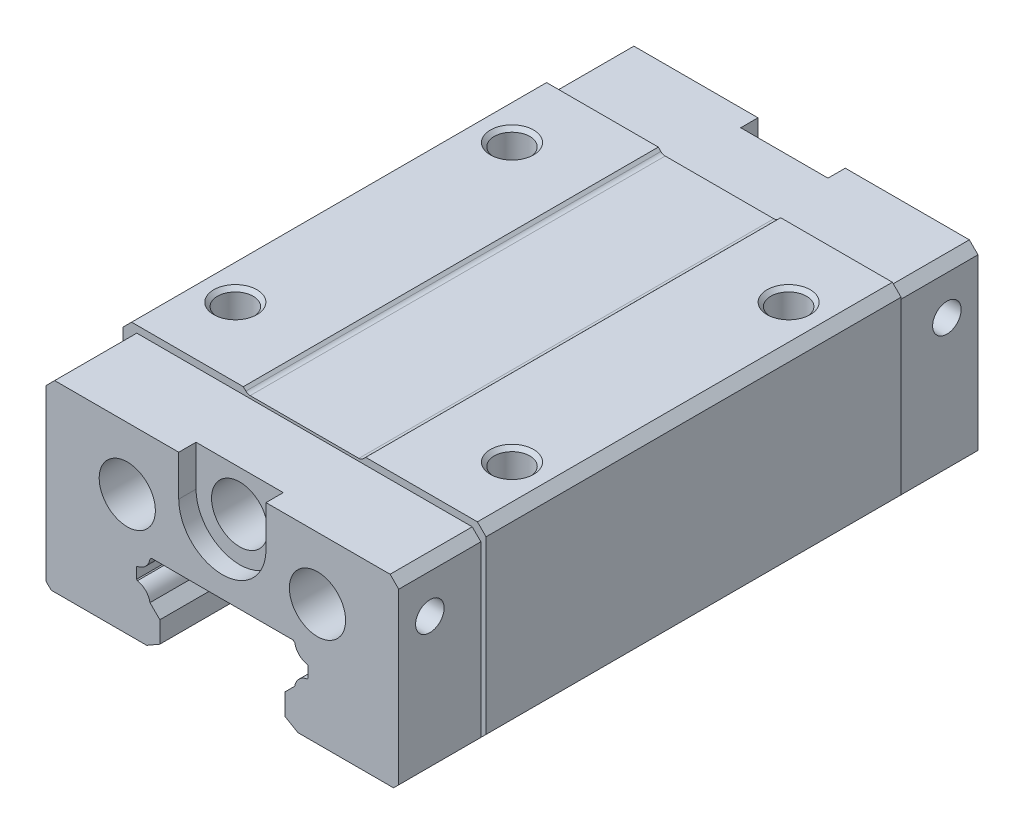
ISO-10303-21;
HEADER;
FILE_DESCRIPTION(('STEP AP214'),'2;1');
FILE_NAME('part.step','',(''),(''),'','','');
FILE_SCHEMA(('AUTOMOTIVE_DESIGN { 1 0 10303 214 1 1 1 1 }'));
ENDSEC;
DATA;
#1=APPLICATION_CONTEXT('core data for automotive mechanical design processes');
#2=APPLICATION_PROTOCOL_DEFINITION('international standard','automotive_design',2000,#1);
#3=PRODUCT_CONTEXT('',#1,'mechanical');
#4=PRODUCT('Part','Part','',(#3));
#5=PRODUCT_RELATED_PRODUCT_CATEGORY('part','',(#4));
#6=PRODUCT_DEFINITION_FORMATION('','',#4);
#7=PRODUCT_DEFINITION_CONTEXT('part definition',#1,'design');
#8=PRODUCT_DEFINITION('design','',#6,#7);
#9=PRODUCT_DEFINITION_SHAPE('','',#8);
#10=(LENGTH_UNIT() NAMED_UNIT(*) SI_UNIT(.MILLI.,.METRE.));
#11=(NAMED_UNIT(*) PLANE_ANGLE_UNIT() SI_UNIT($,.RADIAN.));
#12=(NAMED_UNIT(*) SI_UNIT($,.STERADIAN.) SOLID_ANGLE_UNIT());
#13=UNCERTAINTY_MEASURE_WITH_UNIT(LENGTH_MEASURE(1.E-05),#10,'distance_accuracy_value','');
#14=(GEOMETRIC_REPRESENTATION_CONTEXT(3) GLOBAL_UNCERTAINTY_ASSIGNED_CONTEXT((#13)) GLOBAL_UNIT_ASSIGNED_CONTEXT((#10,
#11,#12)) REPRESENTATION_CONTEXT('',''));
#15=CARTESIAN_POINT('',(0.,0.,0.));
#16=DIRECTION('',(0.,0.,1.));
#17=DIRECTION('',(1.,0.,0.));
#18=AXIS2_PLACEMENT_3D('',#15,#16,#17);
#19=CARTESIAN_POINT('',(-20.3999965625,-22.,-67.));
#20=DIRECTION('',(0.,0.,-1.));
#21=DIRECTION('',(0.,1.,0.));
#22=AXIS2_PLACEMENT_3D('',#19,#20,#21);
#23=PLANE('',#22);
#24=DIRECTION('',(0.,-1.,0.));
#25=VECTOR('',#24,1.);
#26=CARTESIAN_POINT('',(-5.0466637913,-0.799999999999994,-67.));
#27=LINE('',#26,#25);
#28=CARTESIAN_POINT('',(-5.0466637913,-0.799999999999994,-67.));
#29=VERTEX_POINT('',#28);
#30=CARTESIAN_POINT('',(-5.0466637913,-5.5,-67.));
#31=VERTEX_POINT('',#30);
#32=EDGE_CURVE('E387',#29,#31,#27,.T.);
#33=ORIENTED_EDGE('',*,*,#32,.T.);
#34=CARTESIAN_POINT('',(0.,-5.5,-67.));
#35=DIRECTION('',(0.,0.,1.));
#36=DIRECTION('',(-1.,0.,0.));
#37=AXIS2_PLACEMENT_3D('',#34,#35,#36);
#38=CIRCLE('',#37,5.0466637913);
#39=CARTESIAN_POINT('',(5.0466637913,-5.5,-67.));
#40=VERTEX_POINT('',#39);
#41=EDGE_CURVE('E375',#31,#40,#38,.T.);
#42=ORIENTED_EDGE('',*,*,#41,.T.);
#43=DIRECTION('',(0.,1.,0.));
#44=VECTOR('',#43,1.);
#45=CARTESIAN_POINT('',(5.0466637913,-5.5,-67.));
#46=LINE('',#45,#44);
#47=CARTESIAN_POINT('',(5.0466637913,-0.799999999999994,-67.));
#48=VERTEX_POINT('',#47);
#49=EDGE_CURVE('E386',#40,#48,#46,.T.);
#50=ORIENTED_EDGE('',*,*,#49,.T.);
#51=DIRECTION('',(1.,0.,0.));
#52=VECTOR('',#51,1.);
#53=CARTESIAN_POINT('',(5.0466637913,-0.799999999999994,-67.));
#54=LINE('',#53,#52);
#55=CARTESIAN_POINT('',(19.400004,-0.799999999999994,-67.));
#56=VERTEX_POINT('',#55);
#57=EDGE_CURVE('E408',#56,#48,#54,.F.);
#58=ORIENTED_EDGE('',*,*,#57,.F.);
#59=DIRECTION('',(0.707106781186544,-0.707106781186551,0.));
#60=VECTOR('',#59,1.);
#61=CARTESIAN_POINT('',(19.400004,-0.799999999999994,-67.));
#62=LINE('',#61,#60);
#63=CARTESIAN_POINT('',(20.400004,-1.8,-67.));
#64=VERTEX_POINT('',#63);
#65=EDGE_CURVE('E413',#64,#56,#62,.F.);
#66=ORIENTED_EDGE('',*,*,#65,.F.);
#67=DIRECTION('',(-5.73979681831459E-08,-0.999999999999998,0.));
#68=VECTOR('',#67,1.);
#69=CARTESIAN_POINT('',(20.400004,-1.8,-67.));
#70=LINE('',#69,#68);
#71=CARTESIAN_POINT('',(20.400002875,-21.399997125,-67.));
#72=VERTEX_POINT('',#71);
#73=EDGE_CURVE('E417',#72,#64,#70,.F.);
#74=ORIENTED_EDGE('',*,*,#73,.F.);
#75=DIRECTION('',(-0.707106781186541,-0.707106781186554,0.));
#76=VECTOR('',#75,1.);
#77=CARTESIAN_POINT('',(20.400002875,-21.399997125,-67.));
#78=LINE('',#77,#76);
#79=CARTESIAN_POINT('',(19.8,-22.,-67.));
#80=VERTEX_POINT('',#79);
#81=EDGE_CURVE('E421',#80,#72,#78,.F.);
#82=ORIENTED_EDGE('',*,*,#81,.F.);
#83=DIRECTION('',(-1.,0.,0.));
#84=VECTOR('',#83,1.);
#85=CARTESIAN_POINT('',(19.8,-22.,-67.));
#86=LINE('',#85,#84);
#87=CARTESIAN_POINT('',(8.74833395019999,-22.,-67.));
#88=VERTEX_POINT('',#87);
#89=EDGE_CURVE('E426',#88,#80,#86,.F.);
#90=ORIENTED_EDGE('',*,*,#89,.F.);
#91=DIRECTION('',(-0.866025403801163,0.499999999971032,0.));
#92=VECTOR('',#91,1.);
#93=CARTESIAN_POINT('',(8.74833395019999,-22.,-67.));
#94=LINE('',#93,#92);
#95=CARTESIAN_POINT('',(7.23,-21.1233894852,-67.));
#96=VERTEX_POINT('',#95);
#97=EDGE_CURVE('E430',#96,#88,#94,.F.);
#98=ORIENTED_EDGE('',*,*,#97,.F.);
#99=DIRECTION('',(0.,1.,0.));
#100=VECTOR('',#99,1.);
#101=CARTESIAN_POINT('',(7.23,-21.1233894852,-67.));
#102=LINE('',#101,#100);
#103=CARTESIAN_POINT('',(7.23,-18.6739487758,-67.));
#104=VERTEX_POINT('',#103);
#105=EDGE_CURVE('E435',#104,#96,#102,.F.);
#106=ORIENTED_EDGE('',*,*,#105,.F.);
#107=DIRECTION('',(0.707106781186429,0.707106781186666,0.));
#108=VECTOR('',#107,1.);
#109=CARTESIAN_POINT('',(7.23,-18.6739487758,-67.));
#110=LINE('',#109,#108);
#111=CARTESIAN_POINT('',(8.37238306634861,-17.531565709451,-67.));
#112=VERTEX_POINT('',#111);
#113=EDGE_CURVE('E440',#112,#104,#110,.F.);
#114=ORIENTED_EDGE('',*,*,#113,.F.);
#115=CARTESIAN_POINT('',(10.1449012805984,-17.844901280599,-67.));
#116=DIRECTION('',(0.,0.,-1.));
#117=DIRECTION('',(-0.98473234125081,0.174075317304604,0.));
#118=AXIS2_PLACEMENT_3D('',#115,#116,#117);
#119=CIRCLE('',#118,1.79999999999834);
#120=CARTESIAN_POINT('',(9.83156570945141,-16.072383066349,-67.));
#121=VERTEX_POINT('',#120);
#122=EDGE_CURVE('E445',#121,#112,#119,.F.);
#123=ORIENTED_EDGE('',*,*,#122,.F.);
#124=DIRECTION('',(0.70710678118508,0.707106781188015,0.));
#125=VECTOR('',#124,1.);
#126=CARTESIAN_POINT('',(9.83156570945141,-16.072383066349,-67.));
#127=LINE('',#126,#125);
#128=CARTESIAN_POINT('',(9.93,-15.9739487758,-67.));
#129=VERTEX_POINT('',#128);
#130=EDGE_CURVE('E450',#129,#121,#127,.F.);
#131=ORIENTED_EDGE('',*,*,#130,.F.);
#132=DIRECTION('',(0.,1.,0.));
#133=VECTOR('',#132,1.);
#134=CARTESIAN_POINT('',(9.93,-15.9739487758,-67.));
#135=LINE('',#134,#133);
#136=CARTESIAN_POINT('',(9.93,-14.7260512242,-67.));
#137=VERTEX_POINT('',#136);
#138=EDGE_CURVE('E455',#137,#129,#135,.F.);
#139=ORIENTED_EDGE('',*,*,#138,.F.);
#140=DIRECTION('',(-0.707106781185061,0.707106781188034,0.));
#141=VECTOR('',#140,1.);
#142=CARTESIAN_POINT('',(9.93,-14.7260512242,-67.));
#143=LINE('',#142,#141);
#144=CARTESIAN_POINT('',(9.83156570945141,-14.627616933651,-67.));
#145=VERTEX_POINT('',#144);
#146=EDGE_CURVE('E460',#145,#137,#143,.F.);
#147=ORIENTED_EDGE('',*,*,#146,.F.);
#148=CARTESIAN_POINT('',(10.1449012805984,-12.855098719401,-67.));
#149=DIRECTION('',(0.,0.,-1.));
#150=DIRECTION('',(-0.174075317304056,-0.984732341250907,0.));
#151=AXIS2_PLACEMENT_3D('',#148,#149,#150);
#152=CIRCLE('',#151,1.79999999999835);
#153=CARTESIAN_POINT('',(8.37238306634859,-13.168434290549,-67.));
#154=VERTEX_POINT('',#153);
#155=EDGE_CURVE('E465',#154,#145,#152,.F.);
#156=ORIENTED_EDGE('',*,*,#155,.F.);
#157=DIRECTION('',(-0.707106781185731,0.707106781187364,0.));
#158=VECTOR('',#157,1.);
#159=CARTESIAN_POINT('',(8.37238306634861,-13.168434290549,-67.));
#160=LINE('',#159,#158);
#161=CARTESIAN_POINT('',(8.2039487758,-13.,-67.));
#162=VERTEX_POINT('',#161);
#163=EDGE_CURVE('E470',#162,#154,#160,.F.);
#164=ORIENTED_EDGE('',*,*,#163,.F.);
#165=DIRECTION('',(-1.,0.,0.));
#166=VECTOR('',#165,1.);
#167=CARTESIAN_POINT('',(8.2039487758,-13.,-67.));
#168=LINE('',#167,#166);
#169=CARTESIAN_POINT('',(-8.2039487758,-13.,-67.));
#170=VERTEX_POINT('',#169);
#171=EDGE_CURVE('E475',#170,#162,#168,.F.);
#172=ORIENTED_EDGE('',*,*,#171,.F.);
#173=DIRECTION('',(-0.707106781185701,-0.707106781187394,0.));
#174=VECTOR('',#173,1.);
#175=CARTESIAN_POINT('',(-8.2039487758,-13.,-67.));
#176=LINE('',#175,#174);
#177=CARTESIAN_POINT('',(-8.3723830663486,-13.168434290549,-67.));
#178=VERTEX_POINT('',#177);
#179=EDGE_CURVE('E480',#178,#170,#176,.F.);
#180=ORIENTED_EDGE('',*,*,#179,.F.);
#181=CARTESIAN_POINT('',(-10.1449012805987,-12.8550987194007,-67.));
#182=DIRECTION('',(0.,0.,-1.));
#183=DIRECTION('',(0.984732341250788,-0.174075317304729,0.));
#184=AXIS2_PLACEMENT_3D('',#181,#182,#183);
#185=CIRCLE('',#184,1.79999999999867);
#186=CARTESIAN_POINT('',(-9.8315657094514,-14.627616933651,-67.));
#187=VERTEX_POINT('',#186);
#188=EDGE_CURVE('E485',#187,#178,#185,.F.);
#189=ORIENTED_EDGE('',*,*,#188,.F.);
#190=DIRECTION('',(-0.707106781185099,-0.707106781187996,0.));
#191=VECTOR('',#190,1.);
#192=CARTESIAN_POINT('',(-9.8315657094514,-14.627616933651,-67.));
#193=LINE('',#192,#191);
#194=CARTESIAN_POINT('',(-9.93,-14.7260512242,-67.));
#195=VERTEX_POINT('',#194);
#196=EDGE_CURVE('E490',#195,#187,#193,.F.);
#197=ORIENTED_EDGE('',*,*,#196,.F.);
#198=DIRECTION('',(0.,-1.,0.));
#199=VECTOR('',#198,1.);
#200=CARTESIAN_POINT('',(-9.93,-14.7260512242,-67.));
#201=LINE('',#200,#199);
#202=CARTESIAN_POINT('',(-9.93,-15.9739487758,-67.));
#203=VERTEX_POINT('',#202);
#204=EDGE_CURVE('E495',#203,#195,#201,.F.);
#205=ORIENTED_EDGE('',*,*,#204,.F.);
#206=DIRECTION('',(0.70710678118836,-0.707106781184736,0.));
#207=VECTOR('',#206,1.);
#208=CARTESIAN_POINT('',(-9.93,-15.9739487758,-67.));
#209=LINE('',#208,#207);
#210=CARTESIAN_POINT('',(-9.8315657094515,-16.072383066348,-67.));
#211=VERTEX_POINT('',#210);
#212=EDGE_CURVE('E500',#211,#203,#209,.F.);
#213=ORIENTED_EDGE('',*,*,#212,.F.);
#214=CARTESIAN_POINT('',(-10.1449012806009,-17.8449012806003,-67.));
#215=DIRECTION('',(0.,0.,-1.));
#216=DIRECTION('',(0.174075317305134,0.984732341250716,0.));
#217=AXIS2_PLACEMENT_3D('',#214,#215,#216);
#218=CIRCLE('',#217,1.80000000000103);
#219=CARTESIAN_POINT('',(-8.3723830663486,-17.531565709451,-67.));
#220=VERTEX_POINT('',#219);
#221=EDGE_CURVE('E505',#220,#211,#218,.F.);
#222=ORIENTED_EDGE('',*,*,#221,.F.);
#223=DIRECTION('',(0.707106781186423,-0.707106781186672,0.));
#224=VECTOR('',#223,1.);
#225=CARTESIAN_POINT('',(-8.3723830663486,-17.531565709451,-67.));
#226=LINE('',#225,#224);
#227=CARTESIAN_POINT('',(-7.23,-18.6739487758,-67.));
#228=VERTEX_POINT('',#227);
#229=EDGE_CURVE('E510',#228,#220,#226,.F.);
#230=ORIENTED_EDGE('',*,*,#229,.F.);
#231=DIRECTION('',(0.,-1.,0.));
#232=VECTOR('',#231,1.);
#233=CARTESIAN_POINT('',(-7.23,-18.6739487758,-67.));
#234=LINE('',#233,#232);
#235=CARTESIAN_POINT('',(-7.23,-21.1233894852,-67.));
#236=VERTEX_POINT('',#235);
#237=EDGE_CURVE('E515',#236,#228,#234,.F.);
#238=ORIENTED_EDGE('',*,*,#237,.F.);
#239=DIRECTION('',(-0.866025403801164,-0.499999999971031,0.));
#240=VECTOR('',#239,1.);
#241=CARTESIAN_POINT('',(-7.23,-21.1233894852,-67.));
#242=LINE('',#241,#240);
#243=CARTESIAN_POINT('',(-8.7483339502,-22.,-67.));
#244=VERTEX_POINT('',#243);
#245=EDGE_CURVE('E520',#244,#236,#242,.F.);
#246=ORIENTED_EDGE('',*,*,#245,.F.);
#247=DIRECTION('',(-1.,0.,0.));
#248=VECTOR('',#247,1.);
#249=CARTESIAN_POINT('',(-8.7483339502,-22.,-67.));
#250=LINE('',#249,#248);
#251=CARTESIAN_POINT('',(-19.8,-22.,-67.));
#252=VERTEX_POINT('',#251);
#253=EDGE_CURVE('E525',#252,#244,#250,.F.);
#254=ORIENTED_EDGE('',*,*,#253,.F.);
#255=DIRECTION('',(-0.707106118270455,0.707107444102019,0.));
#256=VECTOR('',#255,1.);
#257=CARTESIAN_POINT('',(-19.8,-22.,-67.));
#258=LINE('',#257,#256);
#259=CARTESIAN_POINT('',(-20.3999965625,-21.4000023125,-67.));
#260=VERTEX_POINT('',#259);
#261=EDGE_CURVE('E530',#260,#252,#258,.F.);
#262=ORIENTED_EDGE('',*,*,#261,.F.);
#263=DIRECTION('',(2.86989763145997E-08,1.,0.));
#264=VECTOR('',#263,1.);
#265=CARTESIAN_POINT('',(-20.3999965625,-21.4000023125,-67.));
#266=LINE('',#265,#264);
#267=CARTESIAN_POINT('',(-20.399996,-1.8,-67.));
#268=VERTEX_POINT('',#267);
#269=EDGE_CURVE('E535',#268,#260,#266,.F.);
#270=ORIENTED_EDGE('',*,*,#269,.F.);
#271=DIRECTION('',(0.707106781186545,0.70710678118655,0.));
#272=VECTOR('',#271,1.);
#273=CARTESIAN_POINT('',(-20.399996,-1.8,-67.));
#274=LINE('',#273,#272);
#275=CARTESIAN_POINT('',(-19.399996,-0.799999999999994,-67.));
#276=VERTEX_POINT('',#275);
#277=EDGE_CURVE('E539',#276,#268,#274,.F.);
#278=ORIENTED_EDGE('',*,*,#277,.F.);
#279=DIRECTION('',(1.,0.,0.));
#280=VECTOR('',#279,1.);
#281=CARTESIAN_POINT('',(-19.399996,-0.799999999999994,-67.));
#282=LINE('',#281,#280);
#283=EDGE_CURVE('E400',#29,#276,#282,.F.);
#284=ORIENTED_EDGE('',*,*,#283,.F.);
#285=EDGE_LOOP('',(#33,#42,#50,#58,#66,#74,#82,#90,#98,#106,#114,#123,#131,#139,#147,#156,#164,
#172,#180,#189,#197,#205,#213,#222,#230,#238,#246,#254,#262,#270,#278,#284));
#286=FACE_BOUND('',#285,.T.);
#287=CARTESIAN_POINT('',(-10.999995,-8.,-67.));
#288=DIRECTION('',(0.,0.,1.));
#289=DIRECTION('',(-1.,0.,0.));
#290=AXIS2_PLACEMENT_3D('',#287,#288,#289);
#291=CIRCLE('',#290,3.25);
#292=CARTESIAN_POINT('',(-14.249995,-8.,-67.));
#293=VERTEX_POINT('',#292);
#294=EDGE_CURVE('E547',#293,#293,#291,.T.);
#295=ORIENTED_EDGE('',*,*,#294,.T.);
#296=EDGE_LOOP('',(#295));
#297=FACE_BOUND('',#296,.T.);
#298=CARTESIAN_POINT('',(10.999996,-8.,-67.));
#299=DIRECTION('',(0.,0.,1.));
#300=DIRECTION('',(-1.,0.,0.));
#301=AXIS2_PLACEMENT_3D('',#298,#299,#300);
#302=CIRCLE('',#301,3.25);
#303=CARTESIAN_POINT('',(7.749996,-8.,-67.));
#304=VERTEX_POINT('',#303);
#305=EDGE_CURVE('E552',#304,#304,#302,.T.);
#306=ORIENTED_EDGE('',*,*,#305,.T.);
#307=EDGE_LOOP('',(#306));
#308=FACE_BOUND('',#307,.T.);
#309=ADVANCED_FACE('F17',(#286,#297,#308),#23,.T.);
#310=CARTESIAN_POINT('',(-19.399996,-0.79999999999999,-57.5));
#311=DIRECTION('',(0.,1.,0.));
#312=DIRECTION('',(1.,0.,0.));
#313=AXIS2_PLACEMENT_3D('',#310,#311,#312);
#314=PLANE('',#313);
#315=DIRECTION('',(0.,0.,-1.));
#316=VECTOR('',#315,1.);
#317=CARTESIAN_POINT('',(-5.0466637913,-0.79999999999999,-65.));
#318=LINE('',#317,#316);
#319=CARTESIAN_POINT('',(-5.0466637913,-0.79999999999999,-65.));
#320=VERTEX_POINT('',#319);
#321=EDGE_CURVE('E555',#29,#320,#318,.F.);
#322=ORIENTED_EDGE('',*,*,#321,.F.);
#323=ORIENTED_EDGE('',*,*,#283,.T.);
#324=DIRECTION('',(0.,0.,1.));
#325=VECTOR('',#324,1.);
#326=CARTESIAN_POINT('',(-19.399996,-0.79999999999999,-67.));
#327=LINE('',#326,#325);
#328=CARTESIAN_POINT('',(-19.399996,-0.79999999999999,-57.5));
#329=VERTEX_POINT('',#328);
#330=EDGE_CURVE('E557',#329,#276,#327,.F.);
#331=ORIENTED_EDGE('',*,*,#330,.F.);
#332=DIRECTION('',(1.,0.,0.));
#333=VECTOR('',#332,1.);
#334=CARTESIAN_POINT('',(-19.399996,-0.79999999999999,-57.5));
#335=LINE('',#334,#333);
#336=CARTESIAN_POINT('',(19.400004,-0.79999999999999,-57.5));
#337=VERTEX_POINT('',#336);
#338=EDGE_CURVE('E561',#337,#329,#335,.F.);
#339=ORIENTED_EDGE('',*,*,#338,.F.);
#340=DIRECTION('',(0.,0.,-1.));
#341=VECTOR('',#340,1.);
#342=CARTESIAN_POINT('',(19.400004,-0.79999999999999,-57.5));
#343=LINE('',#342,#341);
#344=EDGE_CURVE('E565',#337,#56,#343,.T.);
#345=ORIENTED_EDGE('',*,*,#344,.T.);
#346=ORIENTED_EDGE('',*,*,#57,.T.);
#347=DIRECTION('',(0.,0.,1.));
#348=VECTOR('',#347,1.);
#349=CARTESIAN_POINT('',(5.0466637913,-0.79999999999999,-67.));
#350=LINE('',#349,#348);
#351=CARTESIAN_POINT('',(5.0466637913,-0.79999999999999,-65.));
#352=VERTEX_POINT('',#351);
#353=EDGE_CURVE('E570',#352,#48,#350,.F.);
#354=ORIENTED_EDGE('',*,*,#353,.F.);
#355=DIRECTION('',(-1.,0.,0.));
#356=VECTOR('',#355,1.);
#357=CARTESIAN_POINT('',(5.0466637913,-0.79999999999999,-65.));
#358=LINE('',#357,#356);
#359=EDGE_CURVE('E574',#352,#320,#358,.T.);
#360=ORIENTED_EDGE('',*,*,#359,.T.);
#361=EDGE_LOOP('',(#322,#323,#331,#339,#345,#346,#354,#360));
#362=FACE_BOUND('',#361,.T.);
#363=ADVANCED_FACE('F1291',(#362),#314,.T.);
#364=CARTESIAN_POINT('',(-21.,-6.,-57.5));
#365=DIRECTION('',(-1.,0.,0.));
#366=DIRECTION('',(0.,0.,1.));
#367=AXIS2_PLACEMENT_3D('',#364,#365,#366);
#368=PLANE('',#367);
#369=DIRECTION('',(0.,-1.,0.));
#370=VECTOR('',#369,1.);
#371=CARTESIAN_POINT('',(-21.,-1.,-57.5));
#372=LINE('',#371,#370);
#373=CARTESIAN_POINT('',(-21.,-6.,-57.5));
#374=VERTEX_POINT('',#373);
#375=CARTESIAN_POINT('',(-21.,-1.,-57.5));
#376=VERTEX_POINT('',#375);
#377=EDGE_CURVE('E579',#374,#376,#372,.F.);
#378=ORIENTED_EDGE('',*,*,#377,.F.);
#379=DIRECTION('',(0.,0.,1.));
#380=VECTOR('',#379,1.);
#381=CARTESIAN_POINT('',(-21.,-6.,-57.5));
#382=LINE('',#381,#380);
#383=CARTESIAN_POINT('',(-21.,-6.,-9.49999999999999));
#384=VERTEX_POINT('',#383);
#385=EDGE_CURVE('E583',#374,#384,#382,.T.);
#386=ORIENTED_EDGE('',*,*,#385,.T.);
#387=DIRECTION('',(0.,1.,0.));
#388=VECTOR('',#387,1.);
#389=CARTESIAN_POINT('',(-21.,-6.,-9.49999999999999));
#390=LINE('',#389,#388);
#391=CARTESIAN_POINT('',(-21.,-1.,-9.49999999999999));
#392=VERTEX_POINT('',#391);
#393=EDGE_CURVE('E588',#384,#392,#390,.T.);
#394=ORIENTED_EDGE('',*,*,#393,.T.);
#395=DIRECTION('',(0.,0.,-1.));
#396=VECTOR('',#395,1.);
#397=CARTESIAN_POINT('',(-21.,-1.,-9.49999999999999));
#398=LINE('',#397,#396);
#399=EDGE_CURVE('E593',#376,#392,#398,.F.);
#400=ORIENTED_EDGE('',*,*,#399,.F.);
#401=EDGE_LOOP('',(#378,#386,#394,#400));
#402=FACE_BOUND('',#401,.T.);
#403=ADVANCED_FACE('F1296',(#402),#368,.T.);
#404=CARTESIAN_POINT('',(-21.,-6.,-57.5));
#405=DIRECTION('',(-0.707106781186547,-0.707106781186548,0.));
#406=DIRECTION('',(0.707106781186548,-0.707106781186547,0.));
#407=AXIS2_PLACEMENT_3D('',#404,#405,#406);
#408=PLANE('',#407);
#409=DIRECTION('',(0.707106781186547,-0.707106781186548,0.));
#410=VECTOR('',#409,1.);
#411=CARTESIAN_POINT('',(-21.,-6.,-57.5));
#412=LINE('',#411,#410);
#413=CARTESIAN_POINT('',(-20.6,-6.4,-57.5));
#414=VERTEX_POINT('',#413);
#415=EDGE_CURVE('E598',#414,#374,#412,.F.);
#416=ORIENTED_EDGE('',*,*,#415,.F.);
#417=DIRECTION('',(0.,0.,1.));
#418=VECTOR('',#417,1.);
#419=CARTESIAN_POINT('',(-20.6,-6.4,-57.5));
#420=LINE('',#419,#418);
#421=CARTESIAN_POINT('',(-20.6,-6.4,-9.5));
#422=VERTEX_POINT('',#421);
#423=EDGE_CURVE('E602',#414,#422,#420,.T.);
#424=ORIENTED_EDGE('',*,*,#423,.T.);
#425=DIRECTION('',(-0.707106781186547,0.707106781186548,0.));
#426=VECTOR('',#425,1.);
#427=CARTESIAN_POINT('',(-20.6,-6.4,-9.50000000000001));
#428=LINE('',#427,#426);
#429=EDGE_CURVE('E607',#422,#384,#428,.T.);
#430=ORIENTED_EDGE('',*,*,#429,.T.);
#431=ORIENTED_EDGE('',*,*,#385,.F.);
#432=EDGE_LOOP('',(#416,#424,#430,#431));
#433=FACE_BOUND('',#432,.T.);
#434=ADVANCED_FACE('F1302',(#433),#408,.T.);
#435=CARTESIAN_POINT('',(-20.6,-21.2,-57.5));
#436=DIRECTION('',(-1.,0.,0.));
#437=DIRECTION('',(0.,0.,1.));
#438=AXIS2_PLACEMENT_3D('',#435,#436,#437);
#439=PLANE('',#438);
#440=DIRECTION('',(0.,-1.,0.));
#441=VECTOR('',#440,1.);
#442=CARTESIAN_POINT('',(-20.6,-6.4,-57.5));
#443=LINE('',#442,#441);
#444=CARTESIAN_POINT('',(-20.6,-21.2,-57.5));
#445=VERTEX_POINT('',#444);
#446=EDGE_CURVE('E612',#445,#414,#443,.F.);
#447=ORIENTED_EDGE('',*,*,#446,.F.);
#448=DIRECTION('',(0.,0.,1.));
#449=VECTOR('',#448,1.);
#450=CARTESIAN_POINT('',(-20.6,-21.2,-57.5));
#451=LINE('',#450,#449);
#452=CARTESIAN_POINT('',(-20.6,-21.2,-9.49999999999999));
#453=VERTEX_POINT('',#452);
#454=EDGE_CURVE('E616',#445,#453,#451,.T.);
#455=ORIENTED_EDGE('',*,*,#454,.T.);
#456=DIRECTION('',(0.,1.,0.));
#457=VECTOR('',#456,1.);
#458=CARTESIAN_POINT('',(-20.6,-21.2,-9.49999999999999));
#459=LINE('',#458,#457);
#460=EDGE_CURVE('E621',#453,#422,#459,.T.);
#461=ORIENTED_EDGE('',*,*,#460,.T.);
#462=ORIENTED_EDGE('',*,*,#423,.F.);
#463=EDGE_LOOP('',(#447,#455,#461,#462));
#464=FACE_BOUND('',#463,.T.);
#465=ADVANCED_FACE('F1306',(#464),#439,.T.);
#466=CARTESIAN_POINT('',(-20.6,-21.2,-67.));
#467=DIRECTION('',(-0.707106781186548,-0.707106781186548,0.));
#468=DIRECTION('',(0.707106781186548,-0.707106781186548,0.));
#469=AXIS2_PLACEMENT_3D('',#466,#467,#468);
#470=PLANE('',#469);
#471=DIRECTION('',(0.707106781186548,-0.707106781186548,0.));
#472=VECTOR('',#471,1.);
#473=CARTESIAN_POINT('',(-20.6,-21.2,-57.5));
#474=LINE('',#473,#472);
#475=CARTESIAN_POINT('',(-20.399997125,-21.400002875,-57.5));
#476=VERTEX_POINT('',#475);
#477=EDGE_CURVE('E626',#476,#445,#474,.F.);
#478=ORIENTED_EDGE('',*,*,#477,.F.);
#479=DIRECTION('',(0.,0.,-1.));
#480=VECTOR('',#479,1.);
#481=CARTESIAN_POINT('',(-20.399997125,-21.400002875,-57.5));
#482=LINE('',#481,#480);
#483=EDGE_CURVE('E630',#476,#260,#482,.T.);
#484=ORIENTED_EDGE('',*,*,#483,.T.);
#485=ORIENTED_EDGE('',*,*,#261,.T.);
#486=DIRECTION('',(0.,0.,1.));
#487=VECTOR('',#486,1.);
#488=CARTESIAN_POINT('',(-19.8,-22.,-67.));
#489=LINE('',#488,#487);
#490=CARTESIAN_POINT('',(-19.8,-22.,0.));
#491=VERTEX_POINT('',#490);
#492=EDGE_CURVE('E635',#252,#491,#489,.T.);
#493=ORIENTED_EDGE('',*,*,#492,.T.);
#494=DIRECTION('',(-0.707106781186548,0.707106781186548,0.));
#495=VECTOR('',#494,1.);
#496=CARTESIAN_POINT('',(-19.8,-22.,0.));
#497=LINE('',#496,#495);
#498=CARTESIAN_POINT('',(-20.39999825,-21.40000175,0.));
#499=VERTEX_POINT('',#498);
#500=EDGE_CURVE('E640',#499,#491,#497,.F.);
#501=ORIENTED_EDGE('',*,*,#500,.F.);
#502=DIRECTION('',(2.96052634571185E-08,-2.96052634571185E-08,-0.999999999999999));
#503=VECTOR('',#502,1.);
#504=CARTESIAN_POINT('',(-20.39999825,-21.40000175,0.));
#505=LINE('',#504,#503);
#506=CARTESIAN_POINT('',(-20.39999796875,-21.40000203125,-9.5));
#507=VERTEX_POINT('',#506);
#508=EDGE_CURVE('E645',#507,#499,#505,.F.);
#509=ORIENTED_EDGE('',*,*,#508,.F.);
#510=DIRECTION('',(-0.707106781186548,0.707106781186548,0.));
#511=VECTOR('',#510,1.);
#512=CARTESIAN_POINT('',(-20.39999796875,-21.40000203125,-9.5));
#513=LINE('',#512,#511);
#514=EDGE_CURVE('E649',#507,#453,#513,.T.);
#515=ORIENTED_EDGE('',*,*,#514,.T.);
#516=ORIENTED_EDGE('',*,*,#454,.F.);
#517=EDGE_LOOP('',(#478,#484,#485,#493,#501,#509,#515,#516));
#518=FACE_BOUND('',#517,.T.);
#519=ADVANCED_FACE('F1310',(#518),#470,.T.);
#520=CARTESIAN_POINT('',(19.8,-22.,-67.));
#521=DIRECTION('',(0.707106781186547,-0.707106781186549,0.));
#522=DIRECTION('',(0.707106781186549,0.707106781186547,0.));
#523=AXIS2_PLACEMENT_3D('',#520,#521,#522);
#524=PLANE('',#523);
#525=DIRECTION('',(0.70710678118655,0.707106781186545,0.));
#526=VECTOR('',#525,1.);
#527=CARTESIAN_POINT('',(20.40000203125,-21.39999796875,-57.5));
#528=LINE('',#527,#526);
#529=CARTESIAN_POINT('',(21.,-20.8,-57.5));
#530=VERTEX_POINT('',#529);
#531=CARTESIAN_POINT('',(20.40000203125,-21.39999796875,-57.5));
#532=VERTEX_POINT('',#531);
#533=EDGE_CURVE('E654',#530,#532,#528,.F.);
#534=ORIENTED_EDGE('',*,*,#533,.F.);
#535=DIRECTION('',(0.,0.,1.));
#536=VECTOR('',#535,1.);
#537=CARTESIAN_POINT('',(21.,-20.8,-57.5));
#538=LINE('',#537,#536);
#539=CARTESIAN_POINT('',(21.,-20.8,-9.5));
#540=VERTEX_POINT('',#539);
#541=EDGE_CURVE('E658',#530,#540,#538,.T.);
#542=ORIENTED_EDGE('',*,*,#541,.T.);
#543=DIRECTION('',(-0.70710678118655,-0.707106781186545,0.));
#544=VECTOR('',#543,1.);
#545=CARTESIAN_POINT('',(21.,-20.8,-9.5));
#546=LINE('',#545,#544);
#547=CARTESIAN_POINT('',(20.400002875,-21.399997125,-9.5));
#548=VERTEX_POINT('',#547);
#549=EDGE_CURVE('E663',#540,#548,#546,.T.);
#550=ORIENTED_EDGE('',*,*,#549,.T.);
#551=DIRECTION('',(-8.88157888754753E-08,-8.88157888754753E-08,0.999999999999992));
#552=VECTOR('',#551,1.);
#553=CARTESIAN_POINT('',(20.400002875,-21.399997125,-9.5));
#554=LINE('',#553,#552);
#555=CARTESIAN_POINT('',(20.40000203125,-21.39999796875,0.));
#556=VERTEX_POINT('',#555);
#557=EDGE_CURVE('E668',#548,#556,#554,.T.);
#558=ORIENTED_EDGE('',*,*,#557,.T.);
#559=DIRECTION('',(-0.707106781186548,-0.707106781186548,0.));
#560=VECTOR('',#559,1.);
#561=CARTESIAN_POINT('',(20.40000203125,-21.39999796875,0.));
#562=LINE('',#561,#560);
#563=CARTESIAN_POINT('',(19.8,-22.,0.));
#564=VERTEX_POINT('',#563);
#565=EDGE_CURVE('E673',#564,#556,#562,.F.);
#566=ORIENTED_EDGE('',*,*,#565,.F.);
#567=DIRECTION('',(0.,0.,-1.));
#568=VECTOR('',#567,1.);
#569=CARTESIAN_POINT('',(19.8,-22.,0.));
#570=LINE('',#569,#568);
#571=EDGE_CURVE('E678',#80,#564,#570,.F.);
#572=ORIENTED_EDGE('',*,*,#571,.F.);
#573=ORIENTED_EDGE('',*,*,#81,.T.);
#574=DIRECTION('',(-8.88157899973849E-08,-8.88157896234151E-08,0.999999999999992));
#575=VECTOR('',#574,1.);
#576=CARTESIAN_POINT('',(20.400002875,-21.399997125,-67.));
#577=LINE('',#576,#575);
#578=EDGE_CURVE('E682',#532,#72,#577,.F.);
#579=ORIENTED_EDGE('',*,*,#578,.F.);
#580=EDGE_LOOP('',(#534,#542,#550,#558,#566,#572,#573,#579));
#581=FACE_BOUND('',#580,.T.);
#582=ADVANCED_FACE('F1314',(#581),#524,.T.);
#583=CARTESIAN_POINT('',(21.,-20.8,-9.5));
#584=DIRECTION('',(1.,0.,0.));
#585=DIRECTION('',(0.,0.,-1.));
#586=AXIS2_PLACEMENT_3D('',#583,#584,#585);
#587=PLANE('',#586);
#588=DIRECTION('',(0.,1.,0.));
#589=VECTOR('',#588,1.);
#590=CARTESIAN_POINT('',(21.,-20.8,-57.5));
#591=LINE('',#590,#589);
#592=CARTESIAN_POINT('',(21.,-1.,-57.5));
#593=VERTEX_POINT('',#592);
#594=EDGE_CURVE('E686',#593,#530,#591,.F.);
#595=ORIENTED_EDGE('',*,*,#594,.F.);
#596=DIRECTION('',(0.,0.,1.));
#597=VECTOR('',#596,1.);
#598=CARTESIAN_POINT('',(21.,-1.,-57.5));
#599=LINE('',#598,#597);
#600=CARTESIAN_POINT('',(21.,-1.,-9.5));
#601=VERTEX_POINT('',#600);
#602=EDGE_CURVE('E690',#593,#601,#599,.T.);
#603=ORIENTED_EDGE('',*,*,#602,.T.);
#604=DIRECTION('',(0.,-1.,0.));
#605=VECTOR('',#604,1.);
#606=CARTESIAN_POINT('',(21.,-1.,-9.5));
#607=LINE('',#606,#605);
#608=EDGE_CURVE('E695',#601,#540,#607,.T.);
#609=ORIENTED_EDGE('',*,*,#608,.T.);
#610=ORIENTED_EDGE('',*,*,#541,.F.);
#611=EDGE_LOOP('',(#595,#603,#609,#610));
#612=FACE_BOUND('',#611,.T.);
#613=ADVANCED_FACE('F1318',(#612),#587,.T.);
#614=CARTESIAN_POINT('',(21.,-1.,-57.5));
#615=DIRECTION('',(0.707106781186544,0.707106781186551,0.));
#616=DIRECTION('',(-0.707106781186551,0.707106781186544,0.));
#617=AXIS2_PLACEMENT_3D('',#614,#615,#616);
#618=PLANE('',#617);
#619=DIRECTION('',(-0.707106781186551,0.707106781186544,0.));
#620=VECTOR('',#619,1.);
#621=CARTESIAN_POINT('',(21.,-1.,-57.5));
#622=LINE('',#621,#620);
#623=CARTESIAN_POINT('',(20.,0.,-57.5));
#624=VERTEX_POINT('',#623);
#625=EDGE_CURVE('E700',#624,#593,#622,.F.);
#626=ORIENTED_EDGE('',*,*,#625,.F.);
#627=DIRECTION('',(0.,0.,1.));
#628=VECTOR('',#627,1.);
#629=CARTESIAN_POINT('',(20.,0.,-57.5));
#630=LINE('',#629,#628);
#631=CARTESIAN_POINT('',(20.,0.,-9.5));
#632=VERTEX_POINT('',#631);
#633=EDGE_CURVE('E704',#624,#632,#630,.T.);
#634=ORIENTED_EDGE('',*,*,#633,.T.);
#635=DIRECTION('',(0.70710678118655,-0.707106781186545,0.));
#636=VECTOR('',#635,1.);
#637=CARTESIAN_POINT('',(20.,0.,-9.50000000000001));
#638=LINE('',#637,#636);
#639=EDGE_CURVE('E709',#632,#601,#638,.T.);
#640=ORIENTED_EDGE('',*,*,#639,.T.);
#641=ORIENTED_EDGE('',*,*,#602,.F.);
#642=EDGE_LOOP('',(#626,#634,#640,#641));
#643=FACE_BOUND('',#642,.T.);
#644=ADVANCED_FACE('F1322',(#643),#618,.T.);
#645=CARTESIAN_POINT('',(7.0757314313,0.,-57.5));
#646=DIRECTION('',(0.,1.,0.));
#647=DIRECTION('',(0.,0.,1.));
#648=AXIS2_PLACEMENT_3D('',#645,#646,#647);
#649=PLANE('',#648);
#650=DIRECTION('',(-1.,0.,0.));
#651=VECTOR('',#650,1.);
#652=CARTESIAN_POINT('',(20.,0.,-57.5));
#653=LINE('',#652,#651);
#654=CARTESIAN_POINT('',(7.0757314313,0.,-57.5));
#655=VERTEX_POINT('',#654);
#656=EDGE_CURVE('E714',#655,#624,#653,.F.);
#657=ORIENTED_EDGE('',*,*,#656,.F.);
#658=DIRECTION('',(0.,0.,1.));
#659=VECTOR('',#658,1.);
#660=CARTESIAN_POINT('',(7.0757314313,0.,-57.5));
#661=LINE('',#660,#659);
#662=CARTESIAN_POINT('',(7.0757314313,0.,-9.49999999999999));
#663=VERTEX_POINT('',#662);
#664=EDGE_CURVE('E718',#655,#663,#661,.T.);
#665=ORIENTED_EDGE('',*,*,#664,.T.);
#666=DIRECTION('',(1.,0.,0.));
#667=VECTOR('',#666,1.);
#668=CARTESIAN_POINT('',(7.0757314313,0.,-9.49999999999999));
#669=LINE('',#668,#667);
#670=EDGE_CURVE('E723',#663,#632,#669,.T.);
#671=ORIENTED_EDGE('',*,*,#670,.T.);
#672=ORIENTED_EDGE('',*,*,#633,.F.);
#673=EDGE_LOOP('',(#657,#665,#671,#672));
#674=FACE_BOUND('',#673,.T.);
#675=CARTESIAN_POINT('',(16.,0.,-17.5));
#676=DIRECTION('',(0.,-1.,0.));
#677=DIRECTION('',(-1.42053860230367E-07,0.,0.99999999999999));
#678=AXIS2_PLACEMENT_3D('',#675,#676,#677);
#679=CIRCLE('',#678,2.5);
#680=CARTESIAN_POINT('',(15.9999996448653,0.,-15.));
#681=VERTEX_POINT('',#680);
#682=EDGE_CURVE('E728',#681,#681,#679,.T.);
#683=ORIENTED_EDGE('',*,*,#682,.T.);
#684=EDGE_LOOP('',(#683));
#685=FACE_BOUND('',#684,.T.);
#686=CARTESIAN_POINT('',(16.,0.,-49.5));
#687=DIRECTION('',(0.,-1.,0.));
#688=DIRECTION('',(-1.42053782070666E-07,0.,0.99999999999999));
#689=AXIS2_PLACEMENT_3D('',#686,#687,#688);
#690=CIRCLE('',#689,2.5);
#691=CARTESIAN_POINT('',(15.9999996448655,0.,-47.));
#692=VERTEX_POINT('',#691);
#693=EDGE_CURVE('E733',#692,#692,#690,.T.);
#694=ORIENTED_EDGE('',*,*,#693,.T.);
#695=EDGE_LOOP('',(#694));
#696=FACE_BOUND('',#695,.T.);
#697=ADVANCED_FACE('F1326',(#674,#685,#696),#649,.T.);
#698=CARTESIAN_POINT('',(7.0757314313,0.,-57.5));
#699=DIRECTION('',(-0.707106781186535,0.70710678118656,0.));
#700=DIRECTION('',(-0.70710678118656,-0.707106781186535,0.));
#701=AXIS2_PLACEMENT_3D('',#698,#699,#700);
#702=PLANE('',#701);
#703=DIRECTION('',(-0.70710678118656,-0.707106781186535,0.));
#704=VECTOR('',#703,1.);
#705=CARTESIAN_POINT('',(7.0757314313,0.,-57.5));
#706=LINE('',#705,#704);
#707=CARTESIAN_POINT('',(6.78075668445,-0.29497474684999,-57.5));
#708=VERTEX_POINT('',#707);
#709=EDGE_CURVE('E736',#708,#655,#706,.F.);
#710=ORIENTED_EDGE('',*,*,#709,.F.);
#711=DIRECTION('',(0.,0.,1.));
#712=VECTOR('',#711,1.);
#713=CARTESIAN_POINT('',(6.78075668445,-0.29497474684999,-57.5));
#714=LINE('',#713,#712);
#715=CARTESIAN_POINT('',(6.78075668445,-0.29497474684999,-9.50000000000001));
#716=VERTEX_POINT('',#715);
#717=EDGE_CURVE('E738',#708,#716,#714,.T.);
#718=ORIENTED_EDGE('',*,*,#717,.T.);
#719=DIRECTION('',(0.70710678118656,0.707106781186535,0.));
#720=VECTOR('',#719,1.);
#721=CARTESIAN_POINT('',(6.78075668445,-0.29497474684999,-9.50000000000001));
#722=LINE('',#721,#720);
#723=EDGE_CURVE('E743',#716,#663,#722,.T.);
#724=ORIENTED_EDGE('',*,*,#723,.T.);
#725=ORIENTED_EDGE('',*,*,#664,.F.);
#726=EDGE_LOOP('',(#710,#718,#724,#725));
#727=FACE_BOUND('',#726,.T.);
#728=ADVANCED_FACE('F1330',(#727),#702,.T.);
#729=CARTESIAN_POINT('',(6.28578193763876,0.20000000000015,-67.));
#730=DIRECTION('',(0.,0.,1.));
#731=DIRECTION('',(-5.53718909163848E-11,-1.,0.));
#732=AXIS2_PLACEMENT_3D('',#729,#730,#731);
#733=CYLINDRICAL_SURFACE('',#732,0.70000000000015);
#734=ORIENTED_EDGE('',*,*,#717,.F.);
#735=CARTESIAN_POINT('',(6.28578193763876,0.20000000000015,-57.5));
#736=DIRECTION('',(0.,0.,-1.));
#737=DIRECTION('',(0.707106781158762,-0.707106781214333,0.));
#738=AXIS2_PLACEMENT_3D('',#735,#736,#737);
#739=CIRCLE('',#738,0.70000000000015);
#740=CARTESIAN_POINT('',(6.2857819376,-0.500000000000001,-57.5));
#741=VERTEX_POINT('',#740);
#742=EDGE_CURVE('E748',#708,#741,#739,.T.);
#743=ORIENTED_EDGE('',*,*,#742,.T.);
#744=DIRECTION('',(0.,0.,1.));
#745=VECTOR('',#744,1.);
#746=CARTESIAN_POINT('',(6.2857819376,-0.500000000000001,-57.5));
#747=LINE('',#746,#745);
#748=CARTESIAN_POINT('',(6.2857819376,-0.500000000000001,-9.5));
#749=VERTEX_POINT('',#748);
#750=EDGE_CURVE('E753',#741,#749,#747,.T.);
#751=ORIENTED_EDGE('',*,*,#750,.T.);
#752=CARTESIAN_POINT('',(6.28578193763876,0.20000000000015,-9.5));
#753=DIRECTION('',(0.,0.,1.));
#754=DIRECTION('',(-5.53715803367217E-11,-1.,0.));
#755=AXIS2_PLACEMENT_3D('',#752,#753,#754);
#756=CIRCLE('',#755,0.70000000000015);
#757=EDGE_CURVE('E758',#716,#749,#756,.F.);
#758=ORIENTED_EDGE('',*,*,#757,.F.);
#759=EDGE_LOOP('',(#734,#743,#751,#758));
#760=FACE_BOUND('',#759,.T.);
#761=ADVANCED_FACE('F1334',(#760),#733,.F.);
#762=CARTESIAN_POINT('',(-6.2857909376,-0.5,-57.5));
#763=DIRECTION('',(0.,1.,0.));
#764=DIRECTION('',(0.,0.,1.));
#765=AXIS2_PLACEMENT_3D('',#762,#763,#764);
#766=PLANE('',#765);
#767=DIRECTION('',(-1.,0.,0.));
#768=VECTOR('',#767,1.);
#769=CARTESIAN_POINT('',(6.2857819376,-0.5,-57.5));
#770=LINE('',#769,#768);
#771=CARTESIAN_POINT('',(-6.2857909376,-0.5,-57.5));
#772=VERTEX_POINT('',#771);
#773=EDGE_CURVE('E762',#772,#741,#770,.F.);
#774=ORIENTED_EDGE('',*,*,#773,.F.);
#775=DIRECTION('',(0.,0.,1.));
#776=VECTOR('',#775,1.);
#777=CARTESIAN_POINT('',(-6.2857909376,-0.5,-57.5));
#778=LINE('',#777,#776);
#779=CARTESIAN_POINT('',(-6.2857909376,-0.5,-9.49999999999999));
#780=VERTEX_POINT('',#779);
#781=EDGE_CURVE('E766',#772,#780,#778,.T.);
#782=ORIENTED_EDGE('',*,*,#781,.T.);
#783=DIRECTION('',(1.,0.,0.));
#784=VECTOR('',#783,1.);
#785=CARTESIAN_POINT('',(-6.2857909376,-0.5,-9.49999999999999));
#786=LINE('',#785,#784);
#787=EDGE_CURVE('E771',#780,#749,#786,.T.);
#788=ORIENTED_EDGE('',*,*,#787,.T.);
#789=ORIENTED_EDGE('',*,*,#750,.F.);
#790=EDGE_LOOP('',(#774,#782,#788,#789));
#791=FACE_BOUND('',#790,.T.);
#792=ADVANCED_FACE('F1338',(#791),#766,.T.);
#793=CARTESIAN_POINT('',(-6.28579093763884,0.199999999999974,-67.));
#794=DIRECTION('',(0.,0.,1.));
#795=DIRECTION('',(-0.707106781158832,-0.707106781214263,0.));
#796=AXIS2_PLACEMENT_3D('',#793,#794,#795);
#797=CYLINDRICAL_SURFACE('',#796,0.699999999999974);
#798=ORIENTED_EDGE('',*,*,#781,.F.);
#799=CARTESIAN_POINT('',(-6.28579093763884,0.199999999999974,-57.5));
#800=DIRECTION('',(0.,0.,-1.));
#801=DIRECTION('',(5.54857747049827E-11,-1.,0.));
#802=AXIS2_PLACEMENT_3D('',#799,#800,#801);
#803=CIRCLE('',#802,0.699999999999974);
#804=CARTESIAN_POINT('',(-6.78076568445,-0.294974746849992,-57.5));
#805=VERTEX_POINT('',#804);
#806=EDGE_CURVE('E776',#772,#805,#803,.T.);
#807=ORIENTED_EDGE('',*,*,#806,.T.);
#808=DIRECTION('',(0.,0.,1.));
#809=VECTOR('',#808,1.);
#810=CARTESIAN_POINT('',(-6.78076568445,-0.294974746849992,-57.5));
#811=LINE('',#810,#809);
#812=CARTESIAN_POINT('',(-6.78076568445,-0.294974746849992,-9.5));
#813=VERTEX_POINT('',#812);
#814=EDGE_CURVE('E781',#805,#813,#811,.T.);
#815=ORIENTED_EDGE('',*,*,#814,.T.);
#816=CARTESIAN_POINT('',(-6.28579093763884,0.199999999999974,-9.5));
#817=DIRECTION('',(0.,0.,1.));
#818=DIRECTION('',(-0.707106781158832,-0.707106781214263,0.));
#819=AXIS2_PLACEMENT_3D('',#816,#817,#818);
#820=CIRCLE('',#819,0.699999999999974);
#821=EDGE_CURVE('E786',#780,#813,#820,.F.);
#822=ORIENTED_EDGE('',*,*,#821,.F.);
#823=EDGE_LOOP('',(#798,#807,#815,#822));
#824=FACE_BOUND('',#823,.T.);
#825=ADVANCED_FACE('F1342',(#824),#797,.F.);
#826=CARTESIAN_POINT('',(-6.78076568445,-0.29497474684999,-57.5));
#827=DIRECTION('',(0.707106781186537,0.707106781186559,0.));
#828=DIRECTION('',(-0.707106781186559,0.707106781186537,0.));
#829=AXIS2_PLACEMENT_3D('',#826,#827,#828);
#830=PLANE('',#829);
#831=DIRECTION('',(-0.707106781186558,0.707106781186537,0.));
#832=VECTOR('',#831,1.);
#833=CARTESIAN_POINT('',(-6.78076568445,-0.29497474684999,-57.5));
#834=LINE('',#833,#832);
#835=CARTESIAN_POINT('',(-7.0757404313,0.,-57.5));
#836=VERTEX_POINT('',#835);
#837=EDGE_CURVE('E790',#836,#805,#834,.F.);
#838=ORIENTED_EDGE('',*,*,#837,.F.);
#839=DIRECTION('',(0.,0.,1.));
#840=VECTOR('',#839,1.);
#841=CARTESIAN_POINT('',(-7.0757404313,0.,-57.5));
#842=LINE('',#841,#840);
#843=CARTESIAN_POINT('',(-7.0757404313,0.,-9.50000000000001));
#844=VERTEX_POINT('',#843);
#845=EDGE_CURVE('E794',#836,#844,#842,.T.);
#846=ORIENTED_EDGE('',*,*,#845,.T.);
#847=DIRECTION('',(0.707106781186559,-0.707106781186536,0.));
#848=VECTOR('',#847,1.);
#849=CARTESIAN_POINT('',(-7.0757404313,0.,-9.50000000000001));
#850=LINE('',#849,#848);
#851=EDGE_CURVE('E799',#844,#813,#850,.T.);
#852=ORIENTED_EDGE('',*,*,#851,.T.);
#853=ORIENTED_EDGE('',*,*,#814,.F.);
#854=EDGE_LOOP('',(#838,#846,#852,#853));
#855=FACE_BOUND('',#854,.T.);
#856=ADVANCED_FACE('F1346',(#855),#830,.T.);
#857=CARTESIAN_POINT('',(-20.,0.,-57.5));
#858=DIRECTION('',(0.,1.,0.));
#859=DIRECTION('',(0.,0.,1.));
#860=AXIS2_PLACEMENT_3D('',#857,#858,#859);
#861=PLANE('',#860);
#862=DIRECTION('',(-1.,0.,0.));
#863=VECTOR('',#862,1.);
#864=CARTESIAN_POINT('',(-7.0757404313,0.,-57.5));
#865=LINE('',#864,#863);
#866=CARTESIAN_POINT('',(-20.,0.,-57.5));
#867=VERTEX_POINT('',#866);
#868=EDGE_CURVE('E804',#867,#836,#865,.F.);
#869=ORIENTED_EDGE('',*,*,#868,.F.);
#870=DIRECTION('',(0.,0.,1.));
#871=VECTOR('',#870,1.);
#872=CARTESIAN_POINT('',(-20.,0.,-57.5));
#873=LINE('',#872,#871);
#874=CARTESIAN_POINT('',(-20.,0.,-9.49999999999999));
#875=VERTEX_POINT('',#874);
#876=EDGE_CURVE('E808',#867,#875,#873,.T.);
#877=ORIENTED_EDGE('',*,*,#876,.T.);
#878=DIRECTION('',(1.,0.,0.));
#879=VECTOR('',#878,1.);
#880=CARTESIAN_POINT('',(-20.,0.,-9.49999999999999));
#881=LINE('',#880,#879);
#882=EDGE_CURVE('E813',#875,#844,#881,.T.);
#883=ORIENTED_EDGE('',*,*,#882,.T.);
#884=ORIENTED_EDGE('',*,*,#845,.F.);
#885=EDGE_LOOP('',(#869,#877,#883,#884));
#886=FACE_BOUND('',#885,.T.);
#887=CARTESIAN_POINT('',(-16.,0.,-49.5));
#888=DIRECTION('',(0.,-1.,0.));
#889=DIRECTION('',(-1.42053781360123E-07,0.,0.99999999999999));
#890=AXIS2_PLACEMENT_3D('',#887,#888,#889);
#891=CIRCLE('',#890,2.5);
#892=CARTESIAN_POINT('',(-16.0000003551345,0.,-47.));
#893=VERTEX_POINT('',#892);
#894=EDGE_CURVE('E818',#893,#893,#891,.T.);
#895=ORIENTED_EDGE('',*,*,#894,.T.);
#896=EDGE_LOOP('',(#895));
#897=FACE_BOUND('',#896,.T.);
#898=CARTESIAN_POINT('',(-16.,0.,-17.5));
#899=DIRECTION('',(0.,-1.,0.));
#900=DIRECTION('',(-1.42053937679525E-07,0.,0.99999999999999));
#901=AXIS2_PLACEMENT_3D('',#898,#899,#900);
#902=CIRCLE('',#901,2.5);
#903=CARTESIAN_POINT('',(-16.0000003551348,0.,-15.));
#904=VERTEX_POINT('',#903);
#905=EDGE_CURVE('E823',#904,#904,#902,.T.);
#906=ORIENTED_EDGE('',*,*,#905,.T.);
#907=EDGE_LOOP('',(#906));
#908=FACE_BOUND('',#907,.T.);
#909=ADVANCED_FACE('F1350',(#886,#897,#908),#861,.T.);
#910=CARTESIAN_POINT('',(-20.,0.,-57.5));
#911=DIRECTION('',(-0.707106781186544,0.707106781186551,0.));
#912=DIRECTION('',(-0.707106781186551,-0.707106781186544,0.));
#913=AXIS2_PLACEMENT_3D('',#910,#911,#912);
#914=PLANE('',#913);
#915=DIRECTION('',(-0.707106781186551,-0.707106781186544,0.));
#916=VECTOR('',#915,1.);
#917=CARTESIAN_POINT('',(-20.,0.,-57.5));
#918=LINE('',#917,#916);
#919=EDGE_CURVE('E826',#376,#867,#918,.F.);
#920=ORIENTED_EDGE('',*,*,#919,.F.);
#921=ORIENTED_EDGE('',*,*,#399,.T.);
#922=DIRECTION('',(0.70710678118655,0.707106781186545,0.));
#923=VECTOR('',#922,1.);
#924=CARTESIAN_POINT('',(-21.,-0.999999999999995,-9.50000000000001));
#925=LINE('',#924,#923);
#926=EDGE_CURVE('E828',#392,#875,#925,.T.);
#927=ORIENTED_EDGE('',*,*,#926,.T.);
#928=ORIENTED_EDGE('',*,*,#876,.F.);
#929=EDGE_LOOP('',(#920,#921,#927,#928));
#930=FACE_BOUND('',#929,.T.);
#931=ADVANCED_FACE('F1354',(#930),#914,.T.);
#932=CARTESIAN_POINT('',(-20.3999976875,-22.,0.));
#933=DIRECTION('',(0.,0.,1.));
#934=DIRECTION('',(1.,0.,0.));
#935=AXIS2_PLACEMENT_3D('',#932,#933,#934);
#936=PLANE('',#935);
#937=DIRECTION('',(0.,1.,0.));
#938=VECTOR('',#937,1.);
#939=CARTESIAN_POINT('',(-5.04666379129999,-5.5,0.));
#940=LINE('',#939,#938);
#941=CARTESIAN_POINT('',(-5.04666379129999,-0.799999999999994,0.));
#942=VERTEX_POINT('',#941);
#943=CARTESIAN_POINT('',(-5.04666379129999,-5.5,0.));
#944=VERTEX_POINT('',#943);
#945=EDGE_CURVE('E833',#942,#944,#940,.F.);
#946=ORIENTED_EDGE('',*,*,#945,.F.);
#947=DIRECTION('',(-1.,0.,0.));
#948=VECTOR('',#947,1.);
#949=CARTESIAN_POINT('',(-5.04666379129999,-0.799999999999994,0.));
#950=LINE('',#949,#948);
#951=CARTESIAN_POINT('',(-19.399996,-0.799999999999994,0.));
#952=VERTEX_POINT('',#951);
#953=EDGE_CURVE('E838',#942,#952,#950,.T.);
#954=ORIENTED_EDGE('',*,*,#953,.T.);
#955=DIRECTION('',(-0.707106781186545,-0.70710678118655,0.));
#956=VECTOR('',#955,1.);
#957=CARTESIAN_POINT('',(-19.399996,-0.799999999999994,0.));
#958=LINE('',#957,#956);
#959=CARTESIAN_POINT('',(-20.399996,-1.8,0.));
#960=VERTEX_POINT('',#959);
#961=EDGE_CURVE('E843',#952,#960,#958,.T.);
#962=ORIENTED_EDGE('',*,*,#961,.T.);
#963=DIRECTION('',(-8.60969337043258E-08,-0.999999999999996,0.));
#964=VECTOR('',#963,1.);
#965=CARTESIAN_POINT('',(-20.399996,-1.8,0.));
#966=LINE('',#965,#964);
#967=EDGE_CURVE('E848',#960,#499,#966,.T.);
#968=ORIENTED_EDGE('',*,*,#967,.T.);
#969=ORIENTED_EDGE('',*,*,#500,.T.);
#970=DIRECTION('',(1.,0.,0.));
#971=VECTOR('',#970,1.);
#972=CARTESIAN_POINT('',(-19.8,-22.,0.));
#973=LINE('',#972,#971);
#974=CARTESIAN_POINT('',(-8.7483339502,-22.,0.));
#975=VERTEX_POINT('',#974);
#976=EDGE_CURVE('E853',#491,#975,#973,.T.);
#977=ORIENTED_EDGE('',*,*,#976,.T.);
#978=DIRECTION('',(0.866025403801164,0.499999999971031,0.));
#979=VECTOR('',#978,1.);
#980=CARTESIAN_POINT('',(-8.7483339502,-22.,0.));
#981=LINE('',#980,#979);
#982=CARTESIAN_POINT('',(-7.22999999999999,-21.1233894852,0.));
#983=VERTEX_POINT('',#982);
#984=EDGE_CURVE('E858',#975,#983,#981,.T.);
#985=ORIENTED_EDGE('',*,*,#984,.T.);
#986=DIRECTION('',(0.,1.,0.));
#987=VECTOR('',#986,1.);
#988=CARTESIAN_POINT('',(-7.22999999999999,-21.1233894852,0.));
#989=LINE('',#988,#987);
#990=CARTESIAN_POINT('',(-7.22999999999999,-18.6739487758,0.));
#991=VERTEX_POINT('',#990);
#992=EDGE_CURVE('E863',#983,#991,#989,.T.);
#993=ORIENTED_EDGE('',*,*,#992,.T.);
#994=DIRECTION('',(-0.707106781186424,0.707106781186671,0.));
#995=VECTOR('',#994,1.);
#996=CARTESIAN_POINT('',(-7.22999999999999,-18.6739487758,0.));
#997=LINE('',#996,#995);
#998=CARTESIAN_POINT('',(-8.37238306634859,-17.531565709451,0.));
#999=VERTEX_POINT('',#998);
#1000=EDGE_CURVE('E868',#991,#999,#997,.T.);
#1001=ORIENTED_EDGE('',*,*,#1000,.T.);
#1002=CARTESIAN_POINT('',(-10.1449012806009,-17.8449012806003,0.));
#1003=DIRECTION('',(0.,0.,1.));
#1004=DIRECTION('',(0.984732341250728,0.174075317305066,0.));
#1005=AXIS2_PLACEMENT_3D('',#1002,#1003,#1004);
#1006=CIRCLE('',#1005,1.80000000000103);
#1007=CARTESIAN_POINT('',(-9.8315657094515,-16.072383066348,0.));
#1008=VERTEX_POINT('',#1007);
#1009=EDGE_CURVE('E873',#999,#1008,#1006,.T.);
#1010=ORIENTED_EDGE('',*,*,#1009,.T.);
#1011=DIRECTION('',(-0.70710678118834,0.707106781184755,0.));
#1012=VECTOR('',#1011,1.);
#1013=CARTESIAN_POINT('',(-9.8315657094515,-16.072383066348,0.));
#1014=LINE('',#1013,#1012);
#1015=CARTESIAN_POINT('',(-9.92999999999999,-15.9739487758,0.));
#1016=VERTEX_POINT('',#1015);
#1017=EDGE_CURVE('E878',#1008,#1016,#1014,.T.);
#1018=ORIENTED_EDGE('',*,*,#1017,.T.);
#1019=DIRECTION('',(0.,1.,0.));
#1020=VECTOR('',#1019,1.);
#1021=CARTESIAN_POINT('',(-9.92999999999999,-15.9739487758,0.));
#1022=LINE('',#1021,#1020);
#1023=CARTESIAN_POINT('',(-9.92999999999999,-14.7260512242,0.));
#1024=VERTEX_POINT('',#1023);
#1025=EDGE_CURVE('E883',#1016,#1024,#1022,.T.);
#1026=ORIENTED_EDGE('',*,*,#1025,.T.);
#1027=DIRECTION('',(0.707106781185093,0.707106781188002,0.));
#1028=VECTOR('',#1027,1.);
#1029=CARTESIAN_POINT('',(-9.92999999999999,-14.7260512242,0.));
#1030=LINE('',#1029,#1028);
#1031=CARTESIAN_POINT('',(-9.8315657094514,-14.627616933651,0.));
#1032=VERTEX_POINT('',#1031);
#1033=EDGE_CURVE('E888',#1024,#1032,#1030,.T.);
#1034=ORIENTED_EDGE('',*,*,#1033,.T.);
#1035=CARTESIAN_POINT('',(-10.1449012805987,-12.8550987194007,0.));
#1036=DIRECTION('',(0.,0.,1.));
#1037=DIRECTION('',(0.174075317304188,-0.984732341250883,0.));
#1038=AXIS2_PLACEMENT_3D('',#1035,#1036,#1037);
#1039=CIRCLE('',#1038,1.79999999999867);
#1040=CARTESIAN_POINT('',(-8.37238306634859,-13.168434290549,0.));
#1041=VERTEX_POINT('',#1040);
#1042=EDGE_CURVE('E893',#1032,#1041,#1039,.T.);
#1043=ORIENTED_EDGE('',*,*,#1042,.T.);
#1044=DIRECTION('',(0.707106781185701,0.707106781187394,0.));
#1045=VECTOR('',#1044,1.);
#1046=CARTESIAN_POINT('',(-8.37238306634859,-13.168434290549,0.));
#1047=LINE('',#1046,#1045);
#1048=CARTESIAN_POINT('',(-8.2039487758,-13.,0.));
#1049=VERTEX_POINT('',#1048);
#1050=EDGE_CURVE('E898',#1041,#1049,#1047,.T.);
#1051=ORIENTED_EDGE('',*,*,#1050,.T.);
#1052=DIRECTION('',(1.,0.,0.));
#1053=VECTOR('',#1052,1.);
#1054=CARTESIAN_POINT('',(-8.2039487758,-13.,0.));
#1055=LINE('',#1054,#1053);
#1056=CARTESIAN_POINT('',(8.20394877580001,-13.,0.));
#1057=VERTEX_POINT('',#1056);
#1058=EDGE_CURVE('E903',#1049,#1057,#1055,.T.);
#1059=ORIENTED_EDGE('',*,*,#1058,.T.);
#1060=DIRECTION('',(0.707106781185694,-0.707106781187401,0.));
#1061=VECTOR('',#1060,1.);
#1062=CARTESIAN_POINT('',(8.20394877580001,-13.,0.));
#1063=LINE('',#1062,#1061);
#1064=CARTESIAN_POINT('',(8.37238306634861,-13.168434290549,0.));
#1065=VERTEX_POINT('',#1064);
#1066=EDGE_CURVE('E908',#1057,#1065,#1063,.T.);
#1067=ORIENTED_EDGE('',*,*,#1066,.T.);
#1068=CARTESIAN_POINT('',(10.1449012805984,-12.855098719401,0.));
#1069=DIRECTION('',(0.,0.,1.));
#1070=DIRECTION('',(-0.984732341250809,-0.174075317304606,0.));
#1071=AXIS2_PLACEMENT_3D('',#1068,#1069,#1070);
#1072=CIRCLE('',#1071,1.79999999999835);
#1073=CARTESIAN_POINT('',(9.83156570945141,-14.627616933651,0.));
#1074=VERTEX_POINT('',#1073);
#1075=EDGE_CURVE('E913',#1065,#1074,#1072,.T.);
#1076=ORIENTED_EDGE('',*,*,#1075,.T.);
#1077=DIRECTION('',(0.707106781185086,-0.707106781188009,0.));
#1078=VECTOR('',#1077,1.);
#1079=CARTESIAN_POINT('',(9.83156570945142,-14.627616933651,0.));
#1080=LINE('',#1079,#1078);
#1081=CARTESIAN_POINT('',(9.93000000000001,-14.7260512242,0.));
#1082=VERTEX_POINT('',#1081);
#1083=EDGE_CURVE('E918',#1074,#1082,#1080,.T.);
#1084=ORIENTED_EDGE('',*,*,#1083,.T.);
#1085=DIRECTION('',(0.,-1.,0.));
#1086=VECTOR('',#1085,1.);
#1087=CARTESIAN_POINT('',(9.93000000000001,-14.7260512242,0.));
#1088=LINE('',#1087,#1086);
#1089=CARTESIAN_POINT('',(9.93000000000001,-15.9739487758,0.));
#1090=VERTEX_POINT('',#1089);
#1091=EDGE_CURVE('E923',#1082,#1090,#1088,.T.);
#1092=ORIENTED_EDGE('',*,*,#1091,.T.);
#1093=DIRECTION('',(-0.707106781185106,-0.70710678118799,0.));
#1094=VECTOR('',#1093,1.);
#1095=CARTESIAN_POINT('',(9.93000000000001,-15.9739487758,0.));
#1096=LINE('',#1095,#1094);
#1097=CARTESIAN_POINT('',(9.83156570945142,-16.072383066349,0.));
#1098=VERTEX_POINT('',#1097);
#1099=EDGE_CURVE('E928',#1090,#1098,#1096,.T.);
#1100=ORIENTED_EDGE('',*,*,#1099,.T.);
#1101=CARTESIAN_POINT('',(10.1449012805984,-17.844901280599,0.));
#1102=DIRECTION('',(0.,0.,1.));
#1103=DIRECTION('',(-0.17407531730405,0.984732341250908,0.));
#1104=AXIS2_PLACEMENT_3D('',#1101,#1102,#1103);
#1105=CIRCLE('',#1104,1.79999999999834);
#1106=CARTESIAN_POINT('',(8.37238306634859,-17.531565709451,0.));
#1107=VERTEX_POINT('',#1106);
#1108=EDGE_CURVE('E933',#1098,#1107,#1105,.T.);
#1109=ORIENTED_EDGE('',*,*,#1108,.T.);
#1110=DIRECTION('',(-0.707106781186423,-0.707106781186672,0.));
#1111=VECTOR('',#1110,1.);
#1112=CARTESIAN_POINT('',(8.37238306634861,-17.531565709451,0.));
#1113=LINE('',#1112,#1111);
#1114=CARTESIAN_POINT('',(7.23000000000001,-18.6739487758,0.));
#1115=VERTEX_POINT('',#1114);
#1116=EDGE_CURVE('E938',#1107,#1115,#1113,.T.);
#1117=ORIENTED_EDGE('',*,*,#1116,.T.);
#1118=DIRECTION('',(0.,-1.,0.));
#1119=VECTOR('',#1118,1.);
#1120=CARTESIAN_POINT('',(7.23000000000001,-18.6739487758,0.));
#1121=LINE('',#1120,#1119);
#1122=CARTESIAN_POINT('',(7.23000000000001,-21.1233894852,0.));
#1123=VERTEX_POINT('',#1122);
#1124=EDGE_CURVE('E943',#1115,#1123,#1121,.T.);
#1125=ORIENTED_EDGE('',*,*,#1124,.T.);
#1126=DIRECTION('',(0.866025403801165,-0.499999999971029,0.));
#1127=VECTOR('',#1126,1.);
#1128=CARTESIAN_POINT('',(7.23000000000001,-21.1233894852,0.));
#1129=LINE('',#1128,#1127);
#1130=CARTESIAN_POINT('',(8.74833395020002,-22.,0.));
#1131=VERTEX_POINT('',#1130);
#1132=EDGE_CURVE('E948',#1123,#1131,#1129,.T.);
#1133=ORIENTED_EDGE('',*,*,#1132,.T.);
#1134=DIRECTION('',(1.,0.,0.));
#1135=VECTOR('',#1134,1.);
#1136=CARTESIAN_POINT('',(8.74833395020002,-22.,0.));
#1137=LINE('',#1136,#1135);
#1138=EDGE_CURVE('E953',#1131,#564,#1137,.T.);
#1139=ORIENTED_EDGE('',*,*,#1138,.T.);
#1140=ORIENTED_EDGE('',*,*,#565,.T.);
#1141=DIRECTION('',(5.73979636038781E-08,0.999999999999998,0.));
#1142=VECTOR('',#1141,1.);
#1143=CARTESIAN_POINT('',(20.400002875,-21.3999988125,0.));
#1144=LINE('',#1143,#1142);
#1145=CARTESIAN_POINT('',(20.400004,-1.8,0.));
#1146=VERTEX_POINT('',#1145);
#1147=EDGE_CURVE('E958',#556,#1146,#1144,.T.);
#1148=ORIENTED_EDGE('',*,*,#1147,.T.);
#1149=DIRECTION('',(-0.707106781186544,0.707106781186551,0.));
#1150=VECTOR('',#1149,1.);
#1151=CARTESIAN_POINT('',(20.400004,-1.8,0.));
#1152=LINE('',#1151,#1150);
#1153=CARTESIAN_POINT('',(19.400004,-0.799999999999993,0.));
#1154=VERTEX_POINT('',#1153);
#1155=EDGE_CURVE('E963',#1146,#1154,#1152,.T.);
#1156=ORIENTED_EDGE('',*,*,#1155,.T.);
#1157=DIRECTION('',(-1.,0.,0.));
#1158=VECTOR('',#1157,1.);
#1159=CARTESIAN_POINT('',(19.400004,-0.799999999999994,0.));
#1160=LINE('',#1159,#1158);
#1161=CARTESIAN_POINT('',(5.04666379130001,-0.799999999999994,0.));
#1162=VERTEX_POINT('',#1161);
#1163=EDGE_CURVE('E968',#1154,#1162,#1160,.T.);
#1164=ORIENTED_EDGE('',*,*,#1163,.T.);
#1165=DIRECTION('',(0.,-1.,0.));
#1166=VECTOR('',#1165,1.);
#1167=CARTESIAN_POINT('',(5.04666379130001,-0.799999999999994,0.));
#1168=LINE('',#1167,#1166);
#1169=CARTESIAN_POINT('',(5.04666379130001,-5.5,0.));
#1170=VERTEX_POINT('',#1169);
#1171=EDGE_CURVE('E973',#1170,#1162,#1168,.F.);
#1172=ORIENTED_EDGE('',*,*,#1171,.F.);
#1173=CARTESIAN_POINT('',(0.,-5.5,0.));
#1174=DIRECTION('',(0.,0.,-1.));
#1175=DIRECTION('',(1.,0.,0.));
#1176=AXIS2_PLACEMENT_3D('',#1173,#1174,#1175);
#1177=CIRCLE('',#1176,5.0466637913);
#1178=EDGE_CURVE('E977',#944,#1170,#1177,.F.);
#1179=ORIENTED_EDGE('',*,*,#1178,.F.);
#1180=EDGE_LOOP('',(#946,#954,#962,#968,#969,#977,#985,#993,#1001,#1010,#1018,#1026,#1034,#1043,
#1051,#1059,#1067,#1076,#1084,#1092,#1100,#1109,#1117,#1125,#1133,#1139,#1140,#1148,#1156,#1164,
#1172,#1179));
#1181=FACE_BOUND('',#1180,.T.);
#1182=CARTESIAN_POINT('',(-10.999995,-8.,0.));
#1183=DIRECTION('',(0.,0.,-1.));
#1184=DIRECTION('',(1.,0.,0.));
#1185=AXIS2_PLACEMENT_3D('',#1182,#1183,#1184);
#1186=CIRCLE('',#1185,3.25);
#1187=CARTESIAN_POINT('',(-7.749995,-8.,0.));
#1188=VERTEX_POINT('',#1187);
#1189=EDGE_CURVE('E982',#1188,#1188,#1186,.F.);
#1190=ORIENTED_EDGE('',*,*,#1189,.F.);
#1191=EDGE_LOOP('',(#1190));
#1192=FACE_BOUND('',#1191,.T.);
#1193=CARTESIAN_POINT('',(10.999996,-8.,0.));
#1194=DIRECTION('',(0.,0.,-1.));
#1195=DIRECTION('',(1.,0.,0.));
#1196=AXIS2_PLACEMENT_3D('',#1193,#1194,#1195);
#1197=CIRCLE('',#1196,3.25);
#1198=CARTESIAN_POINT('',(14.249996,-8.,0.));
#1199=VERTEX_POINT('',#1198);
#1200=EDGE_CURVE('E987',#1199,#1199,#1197,.F.);
#1201=ORIENTED_EDGE('',*,*,#1200,.F.);
#1202=EDGE_LOOP('',(#1201));
#1203=FACE_BOUND('',#1202,.T.);
#1204=ADVANCED_FACE('F1358',(#1181,#1192,#1203),#936,.T.);
#1205=CARTESIAN_POINT('',(-19.8,-22.,0.));
#1206=DIRECTION('',(0.,-1.,0.));
#1207=DIRECTION('',(0.,0.,-1.));
#1208=AXIS2_PLACEMENT_3D('',#1205,#1206,#1207);
#1209=PLANE('',#1208);
#1210=ORIENTED_EDGE('',*,*,#976,.F.);
#1211=ORIENTED_EDGE('',*,*,#492,.F.);
#1212=ORIENTED_EDGE('',*,*,#253,.T.);
#1213=DIRECTION('',(0.,0.,1.));
#1214=VECTOR('',#1213,1.);
#1215=CARTESIAN_POINT('',(-8.7483339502,-22.,-67.));
#1216=LINE('',#1215,#1214);
#1217=EDGE_CURVE('E990',#244,#975,#1216,.T.);
#1218=ORIENTED_EDGE('',*,*,#1217,.T.);
#1219=EDGE_LOOP('',(#1210,#1211,#1212,#1218));
#1220=FACE_BOUND('',#1219,.T.);
#1221=ADVANCED_FACE('F1362',(#1220),#1209,.T.);
#1222=CARTESIAN_POINT('',(-8.7483339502,-22.,-67.));
#1223=DIRECTION('',(0.499999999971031,-0.866025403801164,0.));
#1224=DIRECTION('',(0.866025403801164,0.499999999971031,0.));
#1225=AXIS2_PLACEMENT_3D('',#1222,#1223,#1224);
#1226=PLANE('',#1225);
#1227=ORIENTED_EDGE('',*,*,#984,.F.);
#1228=ORIENTED_EDGE('',*,*,#1217,.F.);
#1229=ORIENTED_EDGE('',*,*,#245,.T.);
#1230=DIRECTION('',(0.,0.,1.));
#1231=VECTOR('',#1230,1.);
#1232=CARTESIAN_POINT('',(-7.23,-21.1233894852,-67.));
#1233=LINE('',#1232,#1231);
#1234=EDGE_CURVE('E993',#236,#983,#1233,.T.);
#1235=ORIENTED_EDGE('',*,*,#1234,.T.);
#1236=EDGE_LOOP('',(#1227,#1228,#1229,#1235));
#1237=FACE_BOUND('',#1236,.T.);
#1238=ADVANCED_FACE('F1366',(#1237),#1226,.T.);
#1239=CARTESIAN_POINT('',(-7.23,-21.1233894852,0.));
#1240=DIRECTION('',(1.,0.,0.));
#1241=DIRECTION('',(0.,0.,-1.));
#1242=AXIS2_PLACEMENT_3D('',#1239,#1240,#1241);
#1243=PLANE('',#1242);
#1244=ORIENTED_EDGE('',*,*,#237,.T.);
#1245=DIRECTION('',(0.,0.,1.));
#1246=VECTOR('',#1245,1.);
#1247=CARTESIAN_POINT('',(-7.23,-18.6739487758,-67.));
#1248=LINE('',#1247,#1246);
#1249=EDGE_CURVE('E998',#228,#991,#1248,.T.);
#1250=ORIENTED_EDGE('',*,*,#1249,.T.);
#1251=ORIENTED_EDGE('',*,*,#992,.F.);
#1252=ORIENTED_EDGE('',*,*,#1234,.F.);
#1253=EDGE_LOOP('',(#1244,#1250,#1251,#1252));
#1254=FACE_BOUND('',#1253,.T.);
#1255=ADVANCED_FACE('F1370',(#1254),#1243,.T.);
#1256=CARTESIAN_POINT('',(-7.23,-18.6739487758,-67.));
#1257=DIRECTION('',(0.707106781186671,0.707106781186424,0.));
#1258=DIRECTION('',(-0.707106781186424,0.707106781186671,0.));
#1259=AXIS2_PLACEMENT_3D('',#1256,#1257,#1258);
#1260=PLANE('',#1259);
#1261=ORIENTED_EDGE('',*,*,#1000,.F.);
#1262=ORIENTED_EDGE('',*,*,#1249,.F.);
#1263=ORIENTED_EDGE('',*,*,#229,.T.);
#1264=DIRECTION('',(0.,0.,1.));
#1265=VECTOR('',#1264,1.);
#1266=CARTESIAN_POINT('',(-8.3723830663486,-17.531565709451,-67.));
#1267=LINE('',#1266,#1265);
#1268=EDGE_CURVE('E1003',#220,#999,#1267,.T.);
#1269=ORIENTED_EDGE('',*,*,#1268,.T.);
#1270=EDGE_LOOP('',(#1261,#1262,#1263,#1269));
#1271=FACE_BOUND('',#1270,.T.);
#1272=ADVANCED_FACE('F1374',(#1271),#1260,.T.);
#1273=CARTESIAN_POINT('',(-10.1449012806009,-17.8449012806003,-67.));
#1274=DIRECTION('',(0.,0.,1.));
#1275=DIRECTION('',(0.984732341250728,0.174075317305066,0.));
#1276=AXIS2_PLACEMENT_3D('',#1273,#1274,#1275);
#1277=CYLINDRICAL_SURFACE('',#1276,1.80000000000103);
#1278=ORIENTED_EDGE('',*,*,#1009,.F.);
#1279=ORIENTED_EDGE('',*,*,#1268,.F.);
#1280=ORIENTED_EDGE('',*,*,#221,.T.);
#1281=DIRECTION('',(0.,0.,1.));
#1282=VECTOR('',#1281,1.);
#1283=CARTESIAN_POINT('',(-9.8315657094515,-16.072383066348,-67.));
#1284=LINE('',#1283,#1282);
#1285=EDGE_CURVE('E1008',#211,#1008,#1284,.T.);
#1286=ORIENTED_EDGE('',*,*,#1285,.T.);
#1287=EDGE_LOOP('',(#1278,#1279,#1280,#1286));
#1288=FACE_BOUND('',#1287,.T.);
#1289=ADVANCED_FACE('F1378',(#1288),#1277,.T.);
#1290=CARTESIAN_POINT('',(-9.8315657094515,-16.072383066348,-67.));
#1291=DIRECTION('',(0.707106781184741,0.707106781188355,0.));
#1292=DIRECTION('',(-0.707106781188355,0.707106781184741,0.));
#1293=AXIS2_PLACEMENT_3D('',#1290,#1291,#1292);
#1294=PLANE('',#1293);
#1295=ORIENTED_EDGE('',*,*,#1017,.F.);
#1296=ORIENTED_EDGE('',*,*,#1285,.F.);
#1297=ORIENTED_EDGE('',*,*,#212,.T.);
#1298=DIRECTION('',(0.,0.,1.));
#1299=VECTOR('',#1298,1.);
#1300=CARTESIAN_POINT('',(-9.93,-15.9739487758,-67.));
#1301=LINE('',#1300,#1299);
#1302=EDGE_CURVE('E1013',#203,#1016,#1301,.T.);
#1303=ORIENTED_EDGE('',*,*,#1302,.T.);
#1304=EDGE_LOOP('',(#1295,#1296,#1297,#1303));
#1305=FACE_BOUND('',#1304,.T.);
#1306=ADVANCED_FACE('F1382',(#1305),#1294,.T.);
#1307=CARTESIAN_POINT('',(-9.93,-15.9739487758,0.));
#1308=DIRECTION('',(1.,0.,0.));
#1309=DIRECTION('',(0.,0.,-1.));
#1310=AXIS2_PLACEMENT_3D('',#1307,#1308,#1309);
#1311=PLANE('',#1310);
#1312=ORIENTED_EDGE('',*,*,#1025,.F.);
#1313=ORIENTED_EDGE('',*,*,#1302,.F.);
#1314=ORIENTED_EDGE('',*,*,#204,.T.);
#1315=DIRECTION('',(0.,0.,1.));
#1316=VECTOR('',#1315,1.);
#1317=CARTESIAN_POINT('',(-9.93,-14.7260512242,-67.));
#1318=LINE('',#1317,#1316);
#1319=EDGE_CURVE('E1018',#195,#1024,#1318,.T.);
#1320=ORIENTED_EDGE('',*,*,#1319,.T.);
#1321=EDGE_LOOP('',(#1312,#1313,#1314,#1320));
#1322=FACE_BOUND('',#1321,.T.);
#1323=ADVANCED_FACE('F1386',(#1322),#1311,.T.);
#1324=CARTESIAN_POINT('',(-9.93,-14.7260512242,-67.));
#1325=DIRECTION('',(0.707106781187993,-0.707106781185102,0.));
#1326=DIRECTION('',(0.707106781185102,0.707106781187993,0.));
#1327=AXIS2_PLACEMENT_3D('',#1324,#1325,#1326);
#1328=PLANE('',#1327);
#1329=ORIENTED_EDGE('',*,*,#1033,.F.);
#1330=ORIENTED_EDGE('',*,*,#1319,.F.);
#1331=ORIENTED_EDGE('',*,*,#196,.T.);
#1332=DIRECTION('',(0.,0.,1.));
#1333=VECTOR('',#1332,1.);
#1334=CARTESIAN_POINT('',(-9.8315657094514,-14.627616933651,-67.));
#1335=LINE('',#1334,#1333);
#1336=EDGE_CURVE('E1023',#187,#1032,#1335,.T.);
#1337=ORIENTED_EDGE('',*,*,#1336,.T.);
#1338=EDGE_LOOP('',(#1329,#1330,#1331,#1337));
#1339=FACE_BOUND('',#1338,.T.);
#1340=ADVANCED_FACE('F1390',(#1339),#1328,.T.);
#1341=CARTESIAN_POINT('',(-10.1449012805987,-12.8550987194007,-67.));
#1342=DIRECTION('',(0.,0.,1.));
#1343=DIRECTION('',(0.174075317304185,-0.984732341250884,0.));
#1344=AXIS2_PLACEMENT_3D('',#1341,#1342,#1343);
#1345=CYLINDRICAL_SURFACE('',#1344,1.79999999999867);
#1346=ORIENTED_EDGE('',*,*,#1042,.F.);
#1347=ORIENTED_EDGE('',*,*,#1336,.F.);
#1348=ORIENTED_EDGE('',*,*,#188,.T.);
#1349=DIRECTION('',(0.,0.,1.));
#1350=VECTOR('',#1349,1.);
#1351=CARTESIAN_POINT('',(-8.37238306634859,-13.168434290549,-67.));
#1352=LINE('',#1351,#1350);
#1353=EDGE_CURVE('E1028',#178,#1041,#1352,.T.);
#1354=ORIENTED_EDGE('',*,*,#1353,.T.);
#1355=EDGE_LOOP('',(#1346,#1347,#1348,#1354));
#1356=FACE_BOUND('',#1355,.T.);
#1357=ADVANCED_FACE('F1394',(#1356),#1345,.T.);
#1358=CARTESIAN_POINT('',(-8.3723830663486,-13.168434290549,-67.));
#1359=DIRECTION('',(0.707106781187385,-0.70710678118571,0.));
#1360=DIRECTION('',(0.70710678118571,0.707106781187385,0.));
#1361=AXIS2_PLACEMENT_3D('',#1358,#1359,#1360);
#1362=PLANE('',#1361);
#1363=ORIENTED_EDGE('',*,*,#1050,.F.);
#1364=ORIENTED_EDGE('',*,*,#1353,.F.);
#1365=ORIENTED_EDGE('',*,*,#179,.T.);
#1366=DIRECTION('',(0.,0.,1.));
#1367=VECTOR('',#1366,1.);
#1368=CARTESIAN_POINT('',(-8.2039487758,-13.,-67.));
#1369=LINE('',#1368,#1367);
#1370=EDGE_CURVE('E1033',#170,#1049,#1369,.T.);
#1371=ORIENTED_EDGE('',*,*,#1370,.T.);
#1372=EDGE_LOOP('',(#1363,#1364,#1365,#1371));
#1373=FACE_BOUND('',#1372,.T.);
#1374=ADVANCED_FACE('F1398',(#1373),#1362,.T.);
#1375=CARTESIAN_POINT('',(-8.2039487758,-13.,0.));
#1376=DIRECTION('',(0.,-1.,0.));
#1377=DIRECTION('',(0.,0.,-1.));
#1378=AXIS2_PLACEMENT_3D('',#1375,#1376,#1377);
#1379=PLANE('',#1378);
#1380=ORIENTED_EDGE('',*,*,#1058,.F.);
#1381=ORIENTED_EDGE('',*,*,#1370,.F.);
#1382=ORIENTED_EDGE('',*,*,#171,.T.);
#1383=DIRECTION('',(0.,0.,1.));
#1384=VECTOR('',#1383,1.);
#1385=CARTESIAN_POINT('',(8.2039487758,-13.,-67.));
#1386=LINE('',#1385,#1384);
#1387=EDGE_CURVE('E1038',#162,#1057,#1386,.T.);
#1388=ORIENTED_EDGE('',*,*,#1387,.T.);
#1389=EDGE_LOOP('',(#1380,#1381,#1382,#1388));
#1390=FACE_BOUND('',#1389,.T.);
#1391=ADVANCED_FACE('F1402',(#1390),#1379,.T.);
#1392=CARTESIAN_POINT('',(8.2039487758,-13.,-67.));
#1393=DIRECTION('',(-0.707106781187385,-0.70710678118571,0.));
#1394=DIRECTION('',(0.70710678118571,-0.707106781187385,0.));
#1395=AXIS2_PLACEMENT_3D('',#1392,#1393,#1394);
#1396=PLANE('',#1395);
#1397=ORIENTED_EDGE('',*,*,#1066,.F.);
#1398=ORIENTED_EDGE('',*,*,#1387,.F.);
#1399=ORIENTED_EDGE('',*,*,#163,.T.);
#1400=DIRECTION('',(0.,0.,1.));
#1401=VECTOR('',#1400,1.);
#1402=CARTESIAN_POINT('',(8.3723830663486,-13.168434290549,-67.));
#1403=LINE('',#1402,#1401);
#1404=EDGE_CURVE('E1043',#154,#1065,#1403,.T.);
#1405=ORIENTED_EDGE('',*,*,#1404,.T.);
#1406=EDGE_LOOP('',(#1397,#1398,#1399,#1405));
#1407=FACE_BOUND('',#1406,.T.);
#1408=ADVANCED_FACE('F1406',(#1407),#1396,.T.);
#1409=CARTESIAN_POINT('',(10.1449012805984,-12.855098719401,-67.));
#1410=DIRECTION('',(0.,0.,1.));
#1411=DIRECTION('',(-0.98473234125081,-0.174075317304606,0.));
#1412=AXIS2_PLACEMENT_3D('',#1409,#1410,#1411);
#1413=CYLINDRICAL_SURFACE('',#1412,1.79999999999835);
#1414=ORIENTED_EDGE('',*,*,#1075,.F.);
#1415=ORIENTED_EDGE('',*,*,#1404,.F.);
#1416=ORIENTED_EDGE('',*,*,#155,.T.);
#1417=DIRECTION('',(0.,0.,1.));
#1418=VECTOR('',#1417,1.);
#1419=CARTESIAN_POINT('',(9.8315657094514,-14.627616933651,-67.));
#1420=LINE('',#1419,#1418);
#1421=EDGE_CURVE('E1048',#145,#1074,#1420,.T.);
#1422=ORIENTED_EDGE('',*,*,#1421,.T.);
#1423=EDGE_LOOP('',(#1414,#1415,#1416,#1422));
#1424=FACE_BOUND('',#1423,.T.);
#1425=ADVANCED_FACE('F1410',(#1424),#1413,.T.);
#1426=CARTESIAN_POINT('',(9.8315657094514,-14.627616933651,-67.));
#1427=DIRECTION('',(-0.707106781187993,-0.707106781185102,0.));
#1428=DIRECTION('',(0.707106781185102,-0.707106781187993,0.));
#1429=AXIS2_PLACEMENT_3D('',#1426,#1427,#1428);
#1430=PLANE('',#1429);
#1431=ORIENTED_EDGE('',*,*,#1083,.F.);
#1432=ORIENTED_EDGE('',*,*,#1421,.F.);
#1433=ORIENTED_EDGE('',*,*,#146,.T.);
#1434=DIRECTION('',(0.,0.,1.));
#1435=VECTOR('',#1434,1.);
#1436=CARTESIAN_POINT('',(9.93,-14.7260512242,-67.));
#1437=LINE('',#1436,#1435);
#1438=EDGE_CURVE('E1053',#137,#1082,#1437,.T.);
#1439=ORIENTED_EDGE('',*,*,#1438,.T.);
#1440=EDGE_LOOP('',(#1431,#1432,#1433,#1439));
#1441=FACE_BOUND('',#1440,.T.);
#1442=ADVANCED_FACE('F1414',(#1441),#1430,.T.);
#1443=CARTESIAN_POINT('',(9.93,-15.9739487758,-67.));
#1444=DIRECTION('',(-1.,0.,0.));
#1445=DIRECTION('',(0.,0.,1.));
#1446=AXIS2_PLACEMENT_3D('',#1443,#1444,#1445);
#1447=PLANE('',#1446);
#1448=ORIENTED_EDGE('',*,*,#1091,.F.);
#1449=ORIENTED_EDGE('',*,*,#1438,.F.);
#1450=ORIENTED_EDGE('',*,*,#138,.T.);
#1451=DIRECTION('',(0.,0.,1.));
#1452=VECTOR('',#1451,1.);
#1453=CARTESIAN_POINT('',(9.93,-15.9739487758,-67.));
#1454=LINE('',#1453,#1452);
#1455=EDGE_CURVE('E1058',#129,#1090,#1454,.T.);
#1456=ORIENTED_EDGE('',*,*,#1455,.T.);
#1457=EDGE_LOOP('',(#1448,#1449,#1450,#1456));
#1458=FACE_BOUND('',#1457,.T.);
#1459=ADVANCED_FACE('F1418',(#1458),#1447,.T.);
#1460=CARTESIAN_POINT('',(9.93,-15.9739487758,-67.));
#1461=DIRECTION('',(-0.707106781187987,0.707106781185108,0.));
#1462=DIRECTION('',(-0.707106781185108,-0.707106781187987,0.));
#1463=AXIS2_PLACEMENT_3D('',#1460,#1461,#1462);
#1464=PLANE('',#1463);
#1465=ORIENTED_EDGE('',*,*,#1099,.F.);
#1466=ORIENTED_EDGE('',*,*,#1455,.F.);
#1467=ORIENTED_EDGE('',*,*,#130,.T.);
#1468=DIRECTION('',(0.,0.,1.));
#1469=VECTOR('',#1468,1.);
#1470=CARTESIAN_POINT('',(9.8315657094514,-16.072383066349,-67.));
#1471=LINE('',#1470,#1469);
#1472=EDGE_CURVE('E1063',#121,#1098,#1471,.T.);
#1473=ORIENTED_EDGE('',*,*,#1472,.T.);
#1474=EDGE_LOOP('',(#1465,#1466,#1467,#1473));
#1475=FACE_BOUND('',#1474,.T.);
#1476=ADVANCED_FACE('F1422',(#1475),#1464,.T.);
#1477=CARTESIAN_POINT('',(10.1449012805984,-17.844901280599,-67.));
#1478=DIRECTION('',(0.,0.,1.));
#1479=DIRECTION('',(-0.174075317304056,0.984732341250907,0.));
#1480=AXIS2_PLACEMENT_3D('',#1477,#1478,#1479);
#1481=CYLINDRICAL_SURFACE('',#1480,1.79999999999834);
#1482=ORIENTED_EDGE('',*,*,#1108,.F.);
#1483=ORIENTED_EDGE('',*,*,#1472,.F.);
#1484=ORIENTED_EDGE('',*,*,#122,.T.);
#1485=DIRECTION('',(0.,0.,1.));
#1486=VECTOR('',#1485,1.);
#1487=CARTESIAN_POINT('',(8.37238306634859,-17.531565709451,-67.));
#1488=LINE('',#1487,#1486);
#1489=EDGE_CURVE('E1068',#112,#1107,#1488,.T.);
#1490=ORIENTED_EDGE('',*,*,#1489,.T.);
#1491=EDGE_LOOP('',(#1482,#1483,#1484,#1490));
#1492=FACE_BOUND('',#1491,.T.);
#1493=ADVANCED_FACE('F1426',(#1492),#1481,.T.);
#1494=CARTESIAN_POINT('',(8.3723830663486,-17.531565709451,-67.));
#1495=DIRECTION('',(-0.707106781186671,0.707106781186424,0.));
#1496=DIRECTION('',(-0.707106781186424,-0.707106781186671,0.));
#1497=AXIS2_PLACEMENT_3D('',#1494,#1495,#1496);
#1498=PLANE('',#1497);
#1499=ORIENTED_EDGE('',*,*,#1116,.F.);
#1500=ORIENTED_EDGE('',*,*,#1489,.F.);
#1501=ORIENTED_EDGE('',*,*,#113,.T.);
#1502=DIRECTION('',(0.,0.,1.));
#1503=VECTOR('',#1502,1.);
#1504=CARTESIAN_POINT('',(7.23,-18.6739487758,-67.));
#1505=LINE('',#1504,#1503);
#1506=EDGE_CURVE('E1073',#104,#1115,#1505,.T.);
#1507=ORIENTED_EDGE('',*,*,#1506,.T.);
#1508=EDGE_LOOP('',(#1499,#1500,#1501,#1507));
#1509=FACE_BOUND('',#1508,.T.);
#1510=ADVANCED_FACE('F1430',(#1509),#1498,.T.);
#1511=CARTESIAN_POINT('',(7.23,-21.1233894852,-67.));
#1512=DIRECTION('',(-1.,0.,0.));
#1513=DIRECTION('',(0.,0.,1.));
#1514=AXIS2_PLACEMENT_3D('',#1511,#1512,#1513);
#1515=PLANE('',#1514);
#1516=ORIENTED_EDGE('',*,*,#105,.T.);
#1517=DIRECTION('',(0.,0.,1.));
#1518=VECTOR('',#1517,1.);
#1519=CARTESIAN_POINT('',(7.23,-21.1233894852,-67.));
#1520=LINE('',#1519,#1518);
#1521=EDGE_CURVE('E1078',#96,#1123,#1520,.T.);
#1522=ORIENTED_EDGE('',*,*,#1521,.T.);
#1523=ORIENTED_EDGE('',*,*,#1124,.F.);
#1524=ORIENTED_EDGE('',*,*,#1506,.F.);
#1525=EDGE_LOOP('',(#1516,#1522,#1523,#1524));
#1526=FACE_BOUND('',#1525,.T.);
#1527=ADVANCED_FACE('F1434',(#1526),#1515,.T.);
#1528=CARTESIAN_POINT('',(7.23,-21.1233894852,-67.));
#1529=DIRECTION('',(-0.499999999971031,-0.866025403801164,0.));
#1530=DIRECTION('',(0.866025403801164,-0.499999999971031,0.));
#1531=AXIS2_PLACEMENT_3D('',#1528,#1529,#1530);
#1532=PLANE('',#1531);
#1533=ORIENTED_EDGE('',*,*,#1132,.F.);
#1534=ORIENTED_EDGE('',*,*,#1521,.F.);
#1535=ORIENTED_EDGE('',*,*,#97,.T.);
#1536=DIRECTION('',(0.,0.,1.));
#1537=VECTOR('',#1536,1.);
#1538=CARTESIAN_POINT('',(8.7483339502,-22.,-67.));
#1539=LINE('',#1538,#1537);
#1540=EDGE_CURVE('E1083',#88,#1131,#1539,.T.);
#1541=ORIENTED_EDGE('',*,*,#1540,.T.);
#1542=EDGE_LOOP('',(#1533,#1534,#1535,#1541));
#1543=FACE_BOUND('',#1542,.T.);
#1544=ADVANCED_FACE('F1438',(#1543),#1532,.T.);
#1545=CARTESIAN_POINT('',(8.7483339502,-22.,0.));
#1546=DIRECTION('',(0.,-1.,0.));
#1547=DIRECTION('',(0.,0.,-1.));
#1548=AXIS2_PLACEMENT_3D('',#1545,#1546,#1547);
#1549=PLANE('',#1548);
#1550=ORIENTED_EDGE('',*,*,#1138,.F.);
#1551=ORIENTED_EDGE('',*,*,#1540,.F.);
#1552=ORIENTED_EDGE('',*,*,#89,.T.);
#1553=ORIENTED_EDGE('',*,*,#571,.T.);
#1554=EDGE_LOOP('',(#1550,#1551,#1552,#1553));
#1555=FACE_BOUND('',#1554,.T.);
#1556=ADVANCED_FACE('F1442',(#1555),#1549,.T.);
#1557=CARTESIAN_POINT('',(-19.399996,-0.79999999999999,-9.5));
#1558=DIRECTION('',(-0.707106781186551,0.707106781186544,0.));
#1559=DIRECTION('',(-0.707106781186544,-0.707106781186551,0.));
#1560=AXIS2_PLACEMENT_3D('',#1557,#1558,#1559);
#1561=PLANE('',#1560);
#1562=ORIENTED_EDGE('',*,*,#961,.F.);
#1563=DIRECTION('',(0.,0.,-1.));
#1564=VECTOR('',#1563,1.);
#1565=CARTESIAN_POINT('',(-19.399996,-0.79999999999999,0.));
#1566=LINE('',#1565,#1564);
#1567=CARTESIAN_POINT('',(-19.399996,-0.79999999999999,-9.5));
#1568=VERTEX_POINT('',#1567);
#1569=EDGE_CURVE('E1088',#1568,#952,#1566,.F.);
#1570=ORIENTED_EDGE('',*,*,#1569,.F.);
#1571=DIRECTION('',(-0.707106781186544,-0.707106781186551,0.));
#1572=VECTOR('',#1571,1.);
#1573=CARTESIAN_POINT('',(-19.399996,-0.79999999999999,-9.5));
#1574=LINE('',#1573,#1572);
#1575=CARTESIAN_POINT('',(-20.399996,-1.8,-9.5));
#1576=VERTEX_POINT('',#1575);
#1577=EDGE_CURVE('E1092',#1568,#1576,#1574,.T.);
#1578=ORIENTED_EDGE('',*,*,#1577,.T.);
#1579=DIRECTION('',(0.,0.,1.));
#1580=VECTOR('',#1579,1.);
#1581=CARTESIAN_POINT('',(-20.399996,-1.8,-9.5));
#1582=LINE('',#1581,#1580);
#1583=EDGE_CURVE('E1097',#1576,#960,#1582,.T.);
#1584=ORIENTED_EDGE('',*,*,#1583,.T.);
#1585=EDGE_LOOP('',(#1562,#1570,#1578,#1584));
#1586=FACE_BOUND('',#1585,.T.);
#1587=ADVANCED_FACE('F1446',(#1586),#1561,.T.);
#1588=CARTESIAN_POINT('',(-19.399996,-0.79999999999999,-9.5));
#1589=DIRECTION('',(0.,1.,0.));
#1590=DIRECTION('',(0.,0.,1.));
#1591=AXIS2_PLACEMENT_3D('',#1588,#1589,#1590);
#1592=PLANE('',#1591);
#1593=DIRECTION('',(0.,0.,-1.));
#1594=VECTOR('',#1593,1.);
#1595=CARTESIAN_POINT('',(-5.0466637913,-0.79999999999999,0.));
#1596=LINE('',#1595,#1594);
#1597=CARTESIAN_POINT('',(-5.0466637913,-0.79999999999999,-2.));
#1598=VERTEX_POINT('',#1597);
#1599=EDGE_CURVE('E1102',#1598,#942,#1596,.F.);
#1600=ORIENTED_EDGE('',*,*,#1599,.F.);
#1601=DIRECTION('',(1.,0.,0.));
#1602=VECTOR('',#1601,1.);
#1603=CARTESIAN_POINT('',(-5.0466637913,-0.79999999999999,-2.));
#1604=LINE('',#1603,#1602);
#1605=CARTESIAN_POINT('',(5.0466637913,-0.79999999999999,-2.));
#1606=VERTEX_POINT('',#1605);
#1607=EDGE_CURVE('E1106',#1598,#1606,#1604,.T.);
#1608=ORIENTED_EDGE('',*,*,#1607,.T.);
#1609=DIRECTION('',(0.,0.,1.));
#1610=VECTOR('',#1609,1.);
#1611=CARTESIAN_POINT('',(5.0466637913,-0.79999999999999,-2.));
#1612=LINE('',#1611,#1610);
#1613=EDGE_CURVE('E1111',#1162,#1606,#1612,.F.);
#1614=ORIENTED_EDGE('',*,*,#1613,.F.);
#1615=ORIENTED_EDGE('',*,*,#1163,.F.);
#1616=DIRECTION('',(0.,0.,-1.));
#1617=VECTOR('',#1616,1.);
#1618=CARTESIAN_POINT('',(19.400004,-0.79999999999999,0.));
#1619=LINE('',#1618,#1617);
#1620=CARTESIAN_POINT('',(19.400004,-0.79999999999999,-9.5));
#1621=VERTEX_POINT('',#1620);
#1622=EDGE_CURVE('E1116',#1621,#1154,#1619,.F.);
#1623=ORIENTED_EDGE('',*,*,#1622,.F.);
#1624=DIRECTION('',(-1.,0.,0.));
#1625=VECTOR('',#1624,1.);
#1626=CARTESIAN_POINT('',(19.400004,-0.79999999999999,-9.5));
#1627=LINE('',#1626,#1625);
#1628=EDGE_CURVE('E1120',#1621,#1568,#1627,.T.);
#1629=ORIENTED_EDGE('',*,*,#1628,.T.);
#1630=ORIENTED_EDGE('',*,*,#1569,.T.);
#1631=ORIENTED_EDGE('',*,*,#953,.F.);
#1632=EDGE_LOOP('',(#1600,#1608,#1614,#1615,#1623,#1629,#1630,#1631));
#1633=FACE_BOUND('',#1632,.T.);
#1634=ADVANCED_FACE('F1450',(#1633),#1592,.T.);
#1635=CARTESIAN_POINT('',(20.400004,-1.8,-9.5));
#1636=DIRECTION('',(0.707106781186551,0.707106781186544,0.));
#1637=DIRECTION('',(-0.707106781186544,0.707106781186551,0.));
#1638=AXIS2_PLACEMENT_3D('',#1635,#1636,#1637);
#1639=PLANE('',#1638);
#1640=ORIENTED_EDGE('',*,*,#1155,.F.);
#1641=DIRECTION('',(0.,0.,-1.));
#1642=VECTOR('',#1641,1.);
#1643=CARTESIAN_POINT('',(20.400004,-1.8,0.));
#1644=LINE('',#1643,#1642);
#1645=CARTESIAN_POINT('',(20.400004,-1.8,-9.5));
#1646=VERTEX_POINT('',#1645);
#1647=EDGE_CURVE('E1125',#1646,#1146,#1644,.F.);
#1648=ORIENTED_EDGE('',*,*,#1647,.F.);
#1649=DIRECTION('',(-0.707106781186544,0.707106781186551,0.));
#1650=VECTOR('',#1649,1.);
#1651=CARTESIAN_POINT('',(20.400004,-1.8,-9.5));
#1652=LINE('',#1651,#1650);
#1653=EDGE_CURVE('E1129',#1646,#1621,#1652,.T.);
#1654=ORIENTED_EDGE('',*,*,#1653,.T.);
#1655=ORIENTED_EDGE('',*,*,#1622,.T.);
#1656=EDGE_LOOP('',(#1640,#1648,#1654,#1655));
#1657=FACE_BOUND('',#1656,.T.);
#1658=ADVANCED_FACE('F1454',(#1657),#1639,.T.);
#1659=CARTESIAN_POINT('',(20.400004,-21.4000005,0.));
#1660=DIRECTION('',(1.,0.,0.));
#1661=DIRECTION('',(0.,0.,-1.));
#1662=AXIS2_PLACEMENT_3D('',#1659,#1660,#1661);
#1663=PLANE('',#1662);
#1664=ORIENTED_EDGE('',*,*,#1147,.F.);
#1665=ORIENTED_EDGE('',*,*,#557,.F.);
#1666=DIRECTION('',(0.,1.,0.));
#1667=VECTOR('',#1666,1.);
#1668=CARTESIAN_POINT('',(20.400004,-21.399997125,-9.5));
#1669=LINE('',#1668,#1667);
#1670=EDGE_CURVE('E1134',#548,#1646,#1669,.T.);
#1671=ORIENTED_EDGE('',*,*,#1670,.T.);
#1672=ORIENTED_EDGE('',*,*,#1647,.T.);
#1673=EDGE_LOOP('',(#1664,#1665,#1671,#1672));
#1674=FACE_BOUND('',#1673,.T.);
#1675=CARTESIAN_POINT('',(20.400004,-6.3,-3.6));
#1676=DIRECTION('',(-1.,0.,0.));
#1677=DIRECTION('',(0.,0.,-1.));
#1678=AXIS2_PLACEMENT_3D('',#1675,#1676,#1677);
#1679=CIRCLE('',#1678,1.65);
#1680=CARTESIAN_POINT('',(20.400004,-6.3,-5.25));
#1681=VERTEX_POINT('',#1680);
#1682=EDGE_CURVE('E1139',#1681,#1681,#1679,.T.);
#1683=ORIENTED_EDGE('',*,*,#1682,.T.);
#1684=EDGE_LOOP('',(#1683));
#1685=FACE_BOUND('',#1684,.T.);
#1686=ADVANCED_FACE('F1458',(#1674,#1685),#1663,.T.);
#1687=CARTESIAN_POINT('',(-20.399996,-21.400004,-9.5));
#1688=DIRECTION('',(-1.,0.,0.));
#1689=DIRECTION('',(0.,0.,1.));
#1690=AXIS2_PLACEMENT_3D('',#1687,#1688,#1689);
#1691=PLANE('',#1690);
#1692=ORIENTED_EDGE('',*,*,#967,.F.);
#1693=ORIENTED_EDGE('',*,*,#1583,.F.);
#1694=DIRECTION('',(0.,-1.,0.));
#1695=VECTOR('',#1694,1.);
#1696=CARTESIAN_POINT('',(-20.399996,-1.8,-9.5));
#1697=LINE('',#1696,#1695);
#1698=EDGE_CURVE('E1144',#1576,#507,#1697,.T.);
#1699=ORIENTED_EDGE('',*,*,#1698,.T.);
#1700=ORIENTED_EDGE('',*,*,#508,.T.);
#1701=EDGE_LOOP('',(#1692,#1693,#1699,#1700));
#1702=FACE_BOUND('',#1701,.T.);
#1703=CARTESIAN_POINT('',(-20.399996,-6.3,-3.6));
#1704=DIRECTION('',(1.,0.,0.));
#1705=DIRECTION('',(0.,0.,1.));
#1706=AXIS2_PLACEMENT_3D('',#1703,#1704,#1705);
#1707=CIRCLE('',#1706,1.65);
#1708=CARTESIAN_POINT('',(-20.399996,-6.3,-1.95));
#1709=VERTEX_POINT('',#1708);
#1710=EDGE_CURVE('E1147',#1709,#1709,#1707,.T.);
#1711=ORIENTED_EDGE('',*,*,#1710,.T.);
#1712=EDGE_LOOP('',(#1711));
#1713=FACE_BOUND('',#1712,.T.);
#1714=ADVANCED_FACE('F1462',(#1702,#1713),#1691,.T.);
#1715=CARTESIAN_POINT('',(-21.,-21.400004,-9.5));
#1716=DIRECTION('',(0.,0.,1.));
#1717=DIRECTION('',(1.,0.,0.));
#1718=AXIS2_PLACEMENT_3D('',#1715,#1716,#1717);
#1719=PLANE('',#1718);
#1720=ORIENTED_EDGE('',*,*,#1698,.F.);
#1721=ORIENTED_EDGE('',*,*,#1577,.F.);
#1722=ORIENTED_EDGE('',*,*,#1628,.F.);
#1723=ORIENTED_EDGE('',*,*,#1653,.F.);
#1724=ORIENTED_EDGE('',*,*,#1670,.F.);
#1725=ORIENTED_EDGE('',*,*,#549,.F.);
#1726=ORIENTED_EDGE('',*,*,#608,.F.);
#1727=ORIENTED_EDGE('',*,*,#639,.F.);
#1728=ORIENTED_EDGE('',*,*,#670,.F.);
#1729=ORIENTED_EDGE('',*,*,#723,.F.);
#1730=ORIENTED_EDGE('',*,*,#757,.T.);
#1731=ORIENTED_EDGE('',*,*,#787,.F.);
#1732=ORIENTED_EDGE('',*,*,#821,.T.);
#1733=ORIENTED_EDGE('',*,*,#851,.F.);
#1734=ORIENTED_EDGE('',*,*,#882,.F.);
#1735=ORIENTED_EDGE('',*,*,#926,.F.);
#1736=ORIENTED_EDGE('',*,*,#393,.F.);
#1737=ORIENTED_EDGE('',*,*,#429,.F.);
#1738=ORIENTED_EDGE('',*,*,#460,.F.);
#1739=ORIENTED_EDGE('',*,*,#514,.F.);
#1740=EDGE_LOOP('',(#1720,#1721,#1722,#1723,#1724,#1725,#1726,#1727,#1728,#1729,#1730,#1731,
#1732,#1733,#1734,#1735,#1736,#1737,#1738,#1739));
#1741=FACE_BOUND('',#1740,.T.);
#1742=ADVANCED_FACE('F1466',(#1741),#1719,.T.);
#1743=CARTESIAN_POINT('',(-20.399996,-1.80000000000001,-67.));
#1744=DIRECTION('',(-0.707106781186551,0.707106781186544,0.));
#1745=DIRECTION('',(0.,0.,1.));
#1746=AXIS2_PLACEMENT_3D('',#1743,#1744,#1745);
#1747=PLANE('',#1746);
#1748=ORIENTED_EDGE('',*,*,#277,.T.);
#1749=DIRECTION('',(0.,0.,1.));
#1750=VECTOR('',#1749,1.);
#1751=CARTESIAN_POINT('',(-20.399996,-1.80000000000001,-67.));
#1752=LINE('',#1751,#1750);
#1753=CARTESIAN_POINT('',(-20.399996,-1.80000000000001,-57.5));
#1754=VERTEX_POINT('',#1753);
#1755=EDGE_CURVE('E1152',#1754,#268,#1752,.F.);
#1756=ORIENTED_EDGE('',*,*,#1755,.F.);
#1757=DIRECTION('',(0.707106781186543,0.707106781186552,0.));
#1758=VECTOR('',#1757,1.);
#1759=CARTESIAN_POINT('',(-20.399996,-1.80000000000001,-57.5));
#1760=LINE('',#1759,#1758);
#1761=EDGE_CURVE('E1154',#329,#1754,#1760,.F.);
#1762=ORIENTED_EDGE('',*,*,#1761,.F.);
#1763=ORIENTED_EDGE('',*,*,#330,.T.);
#1764=EDGE_LOOP('',(#1748,#1756,#1762,#1763));
#1765=FACE_BOUND('',#1764,.T.);
#1766=ADVANCED_FACE('F1470',(#1765),#1747,.T.);
#1767=CARTESIAN_POINT('',(19.400004,-0.799999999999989,-67.));
#1768=DIRECTION('',(0.707106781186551,0.707106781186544,0.));
#1769=DIRECTION('',(0.,0.,1.));
#1770=AXIS2_PLACEMENT_3D('',#1767,#1768,#1769);
#1771=PLANE('',#1770);
#1772=ORIENTED_EDGE('',*,*,#65,.T.);
#1773=ORIENTED_EDGE('',*,*,#344,.F.);
#1774=DIRECTION('',(0.707106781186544,-0.707106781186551,0.));
#1775=VECTOR('',#1774,1.);
#1776=CARTESIAN_POINT('',(19.400004,-0.79999999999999,-57.5));
#1777=LINE('',#1776,#1775);
#1778=CARTESIAN_POINT('',(20.400004,-1.8,-57.5));
#1779=VERTEX_POINT('',#1778);
#1780=EDGE_CURVE('E1158',#1779,#337,#1777,.F.);
#1781=ORIENTED_EDGE('',*,*,#1780,.F.);
#1782=DIRECTION('',(0.,0.,-1.));
#1783=VECTOR('',#1782,1.);
#1784=CARTESIAN_POINT('',(20.400004,-1.8,-57.5));
#1785=LINE('',#1784,#1783);
#1786=EDGE_CURVE('E1162',#1779,#64,#1785,.T.);
#1787=ORIENTED_EDGE('',*,*,#1786,.T.);
#1788=EDGE_LOOP('',(#1772,#1773,#1781,#1787));
#1789=FACE_BOUND('',#1788,.T.);
#1790=ADVANCED_FACE('F1474',(#1789),#1771,.T.);
#1791=CARTESIAN_POINT('',(20.400004,-21.4000005,-67.));
#1792=DIRECTION('',(1.,0.,0.));
#1793=DIRECTION('',(0.,1.,0.));
#1794=AXIS2_PLACEMENT_3D('',#1791,#1792,#1793);
#1795=PLANE('',#1794);
#1796=ORIENTED_EDGE('',*,*,#73,.T.);
#1797=ORIENTED_EDGE('',*,*,#1786,.F.);
#1798=DIRECTION('',(0.,-1.,0.));
#1799=VECTOR('',#1798,1.);
#1800=CARTESIAN_POINT('',(20.400004,-1.8,-57.5));
#1801=LINE('',#1800,#1799);
#1802=EDGE_CURVE('E1167',#532,#1779,#1801,.F.);
#1803=ORIENTED_EDGE('',*,*,#1802,.F.);
#1804=ORIENTED_EDGE('',*,*,#578,.T.);
#1805=EDGE_LOOP('',(#1796,#1797,#1803,#1804));
#1806=FACE_BOUND('',#1805,.T.);
#1807=CARTESIAN_POINT('',(20.400004,-6.3,-63.4));
#1808=DIRECTION('',(-1.,0.,0.));
#1809=DIRECTION('',(0.,-1.42054139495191E-07,-0.99999999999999));
#1810=AXIS2_PLACEMENT_3D('',#1807,#1808,#1809);
#1811=CIRCLE('',#1810,1.65);
#1812=CARTESIAN_POINT('',(20.400004,-6.30000023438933,-65.05));
#1813=VERTEX_POINT('',#1812);
#1814=EDGE_CURVE('E1171',#1813,#1813,#1811,.F.);
#1815=ORIENTED_EDGE('',*,*,#1814,.F.);
#1816=EDGE_LOOP('',(#1815));
#1817=FACE_BOUND('',#1816,.T.);
#1818=ADVANCED_FACE('F1478',(#1806,#1817),#1795,.T.);
#1819=CARTESIAN_POINT('',(-20.399996,-21.400002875,-57.5));
#1820=DIRECTION('',(-1.,0.,0.));
#1821=DIRECTION('',(0.,1.,0.));
#1822=AXIS2_PLACEMENT_3D('',#1819,#1820,#1821);
#1823=PLANE('',#1822);
#1824=ORIENTED_EDGE('',*,*,#269,.T.);
#1825=ORIENTED_EDGE('',*,*,#483,.F.);
#1826=DIRECTION('',(0.,1.,0.));
#1827=VECTOR('',#1826,1.);
#1828=CARTESIAN_POINT('',(-20.399996,-21.400002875,-57.5));
#1829=LINE('',#1828,#1827);
#1830=EDGE_CURVE('E1176',#1754,#476,#1829,.F.);
#1831=ORIENTED_EDGE('',*,*,#1830,.F.);
#1832=ORIENTED_EDGE('',*,*,#1755,.T.);
#1833=EDGE_LOOP('',(#1824,#1825,#1831,#1832));
#1834=FACE_BOUND('',#1833,.T.);
#1835=CARTESIAN_POINT('',(-20.399996,-6.3,-63.4));
#1836=DIRECTION('',(1.,0.,0.));
#1837=DIRECTION('',(0.,0.,1.));
#1838=AXIS2_PLACEMENT_3D('',#1835,#1836,#1837);
#1839=CIRCLE('',#1838,1.65);
#1840=CARTESIAN_POINT('',(-20.399996,-6.3,-61.75));
#1841=VERTEX_POINT('',#1840);
#1842=EDGE_CURVE('E1178',#1841,#1841,#1839,.F.);
#1843=ORIENTED_EDGE('',*,*,#1842,.F.);
#1844=EDGE_LOOP('',(#1843));
#1845=FACE_BOUND('',#1844,.T.);
#1846=ADVANCED_FACE('F1482',(#1834,#1845),#1823,.T.);
#1847=CARTESIAN_POINT('',(-21.,-21.400004,-57.5));
#1848=DIRECTION('',(0.,0.,-1.));
#1849=DIRECTION('',(0.,1.,0.));
#1850=AXIS2_PLACEMENT_3D('',#1847,#1848,#1849);
#1851=PLANE('',#1850);
#1852=ORIENTED_EDGE('',*,*,#477,.T.);
#1853=ORIENTED_EDGE('',*,*,#446,.T.);
#1854=ORIENTED_EDGE('',*,*,#415,.T.);
#1855=ORIENTED_EDGE('',*,*,#377,.T.);
#1856=ORIENTED_EDGE('',*,*,#919,.T.);
#1857=ORIENTED_EDGE('',*,*,#868,.T.);
#1858=ORIENTED_EDGE('',*,*,#837,.T.);
#1859=ORIENTED_EDGE('',*,*,#806,.F.);
#1860=ORIENTED_EDGE('',*,*,#773,.T.);
#1861=ORIENTED_EDGE('',*,*,#742,.F.);
#1862=ORIENTED_EDGE('',*,*,#709,.T.);
#1863=ORIENTED_EDGE('',*,*,#656,.T.);
#1864=ORIENTED_EDGE('',*,*,#625,.T.);
#1865=ORIENTED_EDGE('',*,*,#594,.T.);
#1866=ORIENTED_EDGE('',*,*,#533,.T.);
#1867=ORIENTED_EDGE('',*,*,#1802,.T.);
#1868=ORIENTED_EDGE('',*,*,#1780,.T.);
#1869=ORIENTED_EDGE('',*,*,#338,.T.);
#1870=ORIENTED_EDGE('',*,*,#1761,.T.);
#1871=ORIENTED_EDGE('',*,*,#1830,.T.);
#1872=EDGE_LOOP('',(#1852,#1853,#1854,#1855,#1856,#1857,#1858,#1859,#1860,#1861,#1862,#1863,
#1864,#1865,#1866,#1867,#1868,#1869,#1870,#1871));
#1873=FACE_BOUND('',#1872,.T.);
#1874=ADVANCED_FACE('F1486',(#1873),#1851,.T.);
#1875=CARTESIAN_POINT('',(-5.0466637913,-5.5,-2.));
#1876=DIRECTION('',(1.,0.,0.));
#1877=DIRECTION('',(0.,1.,0.));
#1878=AXIS2_PLACEMENT_3D('',#1875,#1876,#1877);
#1879=PLANE('',#1878);
#1880=ORIENTED_EDGE('',*,*,#1599,.T.);
#1881=ORIENTED_EDGE('',*,*,#945,.T.);
#1882=DIRECTION('',(0.,0.,-1.));
#1883=VECTOR('',#1882,1.);
#1884=CARTESIAN_POINT('',(-5.0466637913,-5.5,0.));
#1885=LINE('',#1884,#1883);
#1886=CARTESIAN_POINT('',(-5.0466637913,-5.5,-2.));
#1887=VERTEX_POINT('',#1886);
#1888=EDGE_CURVE('E1183',#1887,#944,#1885,.F.);
#1889=ORIENTED_EDGE('',*,*,#1888,.F.);
#1890=DIRECTION('',(0.,1.,0.));
#1891=VECTOR('',#1890,1.);
#1892=CARTESIAN_POINT('',(-5.0466637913,-5.5,-2.));
#1893=LINE('',#1892,#1891);
#1894=EDGE_CURVE('E1185',#1598,#1887,#1893,.F.);
#1895=ORIENTED_EDGE('',*,*,#1894,.F.);
#1896=EDGE_LOOP('',(#1880,#1881,#1889,#1895));
#1897=FACE_BOUND('',#1896,.T.);
#1898=ADVANCED_FACE('F1490',(#1897),#1879,.T.);
#1899=CARTESIAN_POINT('',(0.,-5.5,-2.));
#1900=DIRECTION('',(0.,0.,1.));
#1901=DIRECTION('',(-1.,0.,0.));
#1902=AXIS2_PLACEMENT_3D('',#1899,#1900,#1901);
#1903=CYLINDRICAL_SURFACE('',#1902,5.0466637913);
#1904=ORIENTED_EDGE('',*,*,#1178,.T.);
#1905=DIRECTION('',(0.,0.,-1.));
#1906=VECTOR('',#1905,1.);
#1907=CARTESIAN_POINT('',(5.0466637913,-5.5,0.));
#1908=LINE('',#1907,#1906);
#1909=CARTESIAN_POINT('',(5.0466637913,-5.5,-2.));
#1910=VERTEX_POINT('',#1909);
#1911=EDGE_CURVE('E1189',#1910,#1170,#1908,.F.);
#1912=ORIENTED_EDGE('',*,*,#1911,.F.);
#1913=CARTESIAN_POINT('',(0.,-5.5,-2.));
#1914=DIRECTION('',(0.,0.,-1.));
#1915=DIRECTION('',(1.,0.,0.));
#1916=AXIS2_PLACEMENT_3D('',#1913,#1914,#1915);
#1917=CIRCLE('',#1916,5.0466637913);
#1918=EDGE_CURVE('E1193',#1887,#1910,#1917,.F.);
#1919=ORIENTED_EDGE('',*,*,#1918,.F.);
#1920=ORIENTED_EDGE('',*,*,#1888,.T.);
#1921=EDGE_LOOP('',(#1904,#1912,#1919,#1920));
#1922=FACE_BOUND('',#1921,.T.);
#1923=ADVANCED_FACE('F1494',(#1922),#1903,.F.);
#1924=CARTESIAN_POINT('',(5.0466637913,-5.5,0.));
#1925=DIRECTION('',(-1.,0.,0.));
#1926=DIRECTION('',(0.,1.,0.));
#1927=AXIS2_PLACEMENT_3D('',#1924,#1925,#1926);
#1928=PLANE('',#1927);
#1929=ORIENTED_EDGE('',*,*,#1613,.T.);
#1930=DIRECTION('',(0.,-1.,0.));
#1931=VECTOR('',#1930,1.);
#1932=CARTESIAN_POINT('',(5.0466637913,-0.79999999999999,-2.));
#1933=LINE('',#1932,#1931);
#1934=EDGE_CURVE('E1197',#1910,#1606,#1933,.F.);
#1935=ORIENTED_EDGE('',*,*,#1934,.F.);
#1936=ORIENTED_EDGE('',*,*,#1911,.T.);
#1937=ORIENTED_EDGE('',*,*,#1171,.T.);
#1938=EDGE_LOOP('',(#1929,#1935,#1936,#1937));
#1939=FACE_BOUND('',#1938,.T.);
#1940=ADVANCED_FACE('F1498',(#1939),#1928,.T.);
#1941=CARTESIAN_POINT('',(-5.0466637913,-10.5466637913,-2.));
#1942=DIRECTION('',(0.,0.,1.));
#1943=DIRECTION('',(1.,0.,0.));
#1944=AXIS2_PLACEMENT_3D('',#1941,#1942,#1943);
#1945=PLANE('',#1944);
#1946=ORIENTED_EDGE('',*,*,#1894,.T.);
#1947=ORIENTED_EDGE('',*,*,#1918,.T.);
#1948=ORIENTED_EDGE('',*,*,#1934,.T.);
#1949=ORIENTED_EDGE('',*,*,#1607,.F.);
#1950=EDGE_LOOP('',(#1946,#1947,#1948,#1949));
#1951=FACE_BOUND('',#1950,.T.);
#1952=CARTESIAN_POINT('',(0.,-5.5,-2.));
#1953=DIRECTION('',(0.,0.,-1.));
#1954=DIRECTION('',(1.,0.,0.));
#1955=AXIS2_PLACEMENT_3D('',#1952,#1953,#1954);
#1956=CIRCLE('',#1955,3.25);
#1957=CARTESIAN_POINT('',(3.25,-5.5,-2.));
#1958=VERTEX_POINT('',#1957);
#1959=EDGE_CURVE('E1201',#1958,#1958,#1956,.F.);
#1960=ORIENTED_EDGE('',*,*,#1959,.F.);
#1961=EDGE_LOOP('',(#1960));
#1962=FACE_BOUND('',#1961,.T.);
#1963=ADVANCED_FACE('F1502',(#1951,#1962),#1945,.T.);
#1964=CARTESIAN_POINT('',(-5.0466637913,-5.5,-65.));
#1965=DIRECTION('',(1.,0.,0.));
#1966=DIRECTION('',(0.,0.,-1.));
#1967=AXIS2_PLACEMENT_3D('',#1964,#1965,#1966);
#1968=PLANE('',#1967);
#1969=ORIENTED_EDGE('',*,*,#321,.T.);
#1970=DIRECTION('',(0.,-1.,0.));
#1971=VECTOR('',#1970,1.);
#1972=CARTESIAN_POINT('',(-5.0466637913,-0.79999999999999,-65.));
#1973=LINE('',#1972,#1971);
#1974=CARTESIAN_POINT('',(-5.0466637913,-5.5,-65.));
#1975=VERTEX_POINT('',#1974);
#1976=EDGE_CURVE('E394',#320,#1975,#1973,.T.);
#1977=ORIENTED_EDGE('',*,*,#1976,.T.);
#1978=DIRECTION('',(0.,0.,-1.));
#1979=VECTOR('',#1978,1.);
#1980=CARTESIAN_POINT('',(-5.0466637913,-5.5,-65.));
#1981=LINE('',#1980,#1979);
#1982=EDGE_CURVE('E378',#1975,#31,#1981,.T.);
#1983=ORIENTED_EDGE('',*,*,#1982,.T.);
#1984=ORIENTED_EDGE('',*,*,#32,.F.);
#1985=EDGE_LOOP('',(#1969,#1977,#1983,#1984));
#1986=FACE_BOUND('',#1985,.T.);
#1987=ADVANCED_FACE('F392',(#1986),#1968,.T.);
#1988=CARTESIAN_POINT('',(5.0466637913,-5.5,-67.));
#1989=DIRECTION('',(-1.,0.,0.));
#1990=DIRECTION('',(0.,0.,1.));
#1991=AXIS2_PLACEMENT_3D('',#1988,#1989,#1990);
#1992=PLANE('',#1991);
#1993=ORIENTED_EDGE('',*,*,#353,.T.);
#1994=ORIENTED_EDGE('',*,*,#49,.F.);
#1995=DIRECTION('',(0.,0.,1.));
#1996=VECTOR('',#1995,1.);
#1997=CARTESIAN_POINT('',(5.0466637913,-5.5,-67.));
#1998=LINE('',#1997,#1996);
#1999=CARTESIAN_POINT('',(5.0466637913,-5.5,-65.));
#2000=VERTEX_POINT('',#1999);
#2001=EDGE_CURVE('E381',#2000,#40,#1998,.F.);
#2002=ORIENTED_EDGE('',*,*,#2001,.F.);
#2003=DIRECTION('',(0.,1.,0.));
#2004=VECTOR('',#2003,1.);
#2005=CARTESIAN_POINT('',(5.0466637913,-5.5,-65.));
#2006=LINE('',#2005,#2004);
#2007=EDGE_CURVE('E1212',#2000,#352,#2006,.T.);
#2008=ORIENTED_EDGE('',*,*,#2007,.T.);
#2009=EDGE_LOOP('',(#1993,#1994,#2002,#2008));
#2010=FACE_BOUND('',#2009,.T.);
#2011=ADVANCED_FACE('F1509',(#2010),#1992,.T.);
#2012=CARTESIAN_POINT('',(-5.0466637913,-10.5466637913,-65.));
#2013=DIRECTION('',(0.,0.,-1.));
#2014=DIRECTION('',(0.,1.,0.));
#2015=AXIS2_PLACEMENT_3D('',#2012,#2013,#2014);
#2016=PLANE('',#2015);
#2017=ORIENTED_EDGE('',*,*,#2007,.F.);
#2018=CARTESIAN_POINT('',(0.,-5.5,-65.));
#2019=DIRECTION('',(0.,0.,-1.));
#2020=DIRECTION('',(1.,0.,0.));
#2021=AXIS2_PLACEMENT_3D('',#2018,#2019,#2020);
#2022=CIRCLE('',#2021,5.0466637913);
#2023=EDGE_CURVE('E1217',#1975,#2000,#2022,.F.);
#2024=ORIENTED_EDGE('',*,*,#2023,.F.);
#2025=ORIENTED_EDGE('',*,*,#1976,.F.);
#2026=ORIENTED_EDGE('',*,*,#359,.F.);
#2027=EDGE_LOOP('',(#2017,#2024,#2025,#2026));
#2028=FACE_BOUND('',#2027,.T.);
#2029=CARTESIAN_POINT('',(0.,-5.5,-65.));
#2030=DIRECTION('',(0.,0.,1.));
#2031=DIRECTION('',(-1.,0.,0.));
#2032=AXIS2_PLACEMENT_3D('',#2029,#2030,#2031);
#2033=CIRCLE('',#2032,3.25);
#2034=CARTESIAN_POINT('',(-3.25,-5.5,-65.));
#2035=VERTEX_POINT('',#2034);
#2036=EDGE_CURVE('E1221',#2035,#2035,#2033,.F.);
#2037=ORIENTED_EDGE('',*,*,#2036,.F.);
#2038=EDGE_LOOP('',(#2037));
#2039=FACE_BOUND('',#2038,.T.);
#2040=ADVANCED_FACE('F1512',(#2028,#2039),#2016,.T.);
#2041=CARTESIAN_POINT('',(0.,-5.5,-65.));
#2042=DIRECTION('',(0.,0.,-1.));
#2043=DIRECTION('',(1.,0.,0.));
#2044=AXIS2_PLACEMENT_3D('',#2041,#2042,#2043);
#2045=CYLINDRICAL_SURFACE('',#2044,5.0466637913);
#2046=ORIENTED_EDGE('',*,*,#41,.F.);
#2047=ORIENTED_EDGE('',*,*,#1982,.F.);
#2048=ORIENTED_EDGE('',*,*,#2023,.T.);
#2049=ORIENTED_EDGE('',*,*,#2001,.T.);
#2050=EDGE_LOOP('',(#2046,#2047,#2048,#2049));
#2051=FACE_BOUND('',#2050,.T.);
#2052=ADVANCED_FACE('F377',(#2051),#2045,.F.);
#2053=CARTESIAN_POINT('',(-14.249995,-11.25,-9.5));
#2054=DIRECTION('',(0.,0.,1.));
#2055=DIRECTION('',(1.,0.,0.));
#2056=AXIS2_PLACEMENT_3D('',#2053,#2054,#2055);
#2057=PLANE('',#2056);
#2058=CARTESIAN_POINT('',(-10.999995,-8.,-9.5));
#2059=DIRECTION('',(0.,0.,1.));
#2060=DIRECTION('',(-1.,0.,0.));
#2061=AXIS2_PLACEMENT_3D('',#2058,#2059,#2060);
#2062=CIRCLE('',#2061,3.25);
#2063=CARTESIAN_POINT('',(-14.249995,-8.,-9.5));
#2064=VERTEX_POINT('',#2063);
#2065=EDGE_CURVE('E1226',#2064,#2064,#2062,.T.);
#2066=ORIENTED_EDGE('',*,*,#2065,.T.);
#2067=EDGE_LOOP('',(#2066));
#2068=FACE_BOUND('',#2067,.T.);
#2069=ADVANCED_FACE('F1519',(#2068),#2057,.T.);
#2070=CARTESIAN_POINT('',(-14.2499952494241,-11.25,-57.5));
#2071=DIRECTION('',(0.,0.,-1.));
#2072=DIRECTION('',(0.,1.,0.));
#2073=AXIS2_PLACEMENT_3D('',#2070,#2071,#2072);
#2074=PLANE('',#2073);
#2075=CARTESIAN_POINT('',(-10.999995,-8.,-57.5));
#2076=DIRECTION('',(0.,0.,-1.));
#2077=DIRECTION('',(1.,0.,0.));
#2078=AXIS2_PLACEMENT_3D('',#2075,#2076,#2077);
#2079=CIRCLE('',#2078,3.25);
#2080=CARTESIAN_POINT('',(-7.749995,-8.,-57.5));
#2081=VERTEX_POINT('',#2080);
#2082=EDGE_CURVE('E1229',#2081,#2081,#2079,.F.);
#2083=ORIENTED_EDGE('',*,*,#2082,.F.);
#2084=EDGE_LOOP('',(#2083));
#2085=FACE_BOUND('',#2084,.T.);
#2086=ADVANCED_FACE('F1522',(#2085),#2074,.T.);
#2087=CARTESIAN_POINT('',(-3.25,-8.75,-9.5));
#2088=DIRECTION('',(0.,0.,1.));
#2089=DIRECTION('',(1.,0.,0.));
#2090=AXIS2_PLACEMENT_3D('',#2087,#2088,#2089);
#2091=PLANE('',#2090);
#2092=CARTESIAN_POINT('',(0.,-5.5,-9.5));
#2093=DIRECTION('',(0.,0.,1.));
#2094=DIRECTION('',(-1.,0.,0.));
#2095=AXIS2_PLACEMENT_3D('',#2092,#2093,#2094);
#2096=CIRCLE('',#2095,3.25);
#2097=CARTESIAN_POINT('',(-3.25,-5.5,-9.5));
#2098=VERTEX_POINT('',#2097);
#2099=EDGE_CURVE('E1232',#2098,#2098,#2096,.T.);
#2100=ORIENTED_EDGE('',*,*,#2099,.T.);
#2101=EDGE_LOOP('',(#2100));
#2102=FACE_BOUND('',#2101,.T.);
#2103=ADVANCED_FACE('F1526',(#2102),#2091,.T.);
#2104=CARTESIAN_POINT('',(-3.25,-8.74999984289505,-57.5));
#2105=DIRECTION('',(0.,0.,-1.));
#2106=DIRECTION('',(0.,1.,0.));
#2107=AXIS2_PLACEMENT_3D('',#2104,#2105,#2106);
#2108=PLANE('',#2107);
#2109=CARTESIAN_POINT('',(0.,-5.5,-57.5));
#2110=DIRECTION('',(0.,0.,-1.));
#2111=DIRECTION('',(0.99999999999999,-1.41721827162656E-07,0.));
#2112=AXIS2_PLACEMENT_3D('',#2109,#2110,#2111);
#2113=CIRCLE('',#2112,3.25);
#2114=CARTESIAN_POINT('',(3.24999999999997,-5.50000046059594,-57.5));
#2115=VERTEX_POINT('',#2114);
#2116=EDGE_CURVE('E1235',#2115,#2115,#2113,.F.);
#2117=ORIENTED_EDGE('',*,*,#2116,.F.);
#2118=EDGE_LOOP('',(#2117));
#2119=FACE_BOUND('',#2118,.T.);
#2120=ADVANCED_FACE('F1530',(#2119),#2108,.T.);
#2121=CARTESIAN_POINT('',(7.749996,-11.25,-9.5));
#2122=DIRECTION('',(0.,0.,1.));
#2123=DIRECTION('',(1.,0.,0.));
#2124=AXIS2_PLACEMENT_3D('',#2121,#2122,#2123);
#2125=PLANE('',#2124);
#2126=CARTESIAN_POINT('',(10.999996,-8.,-9.5));
#2127=DIRECTION('',(0.,0.,1.));
#2128=DIRECTION('',(-1.,0.,0.));
#2129=AXIS2_PLACEMENT_3D('',#2126,#2127,#2128);
#2130=CIRCLE('',#2129,3.25);
#2131=CARTESIAN_POINT('',(7.749996,-8.,-9.5));
#2132=VERTEX_POINT('',#2131);
#2133=EDGE_CURVE('E1238',#2132,#2132,#2130,.T.);
#2134=ORIENTED_EDGE('',*,*,#2133,.T.);
#2135=EDGE_LOOP('',(#2134));
#2136=FACE_BOUND('',#2135,.T.);
#2137=ADVANCED_FACE('F1534',(#2136),#2125,.T.);
#2138=CARTESIAN_POINT('',(7.74999575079,-11.25,-57.5));
#2139=DIRECTION('',(0.,0.,-1.));
#2140=DIRECTION('',(0.,1.,0.));
#2141=AXIS2_PLACEMENT_3D('',#2138,#2139,#2140);
#2142=PLANE('',#2141);
#2143=CARTESIAN_POINT('',(10.999996,-8.,-57.5));
#2144=DIRECTION('',(0.,0.,-1.));
#2145=DIRECTION('',(1.,0.,0.));
#2146=AXIS2_PLACEMENT_3D('',#2143,#2144,#2145);
#2147=CIRCLE('',#2146,3.25);
#2148=CARTESIAN_POINT('',(14.249996,-8.,-57.5));
#2149=VERTEX_POINT('',#2148);
#2150=EDGE_CURVE('E1241',#2149,#2149,#2147,.F.);
#2151=ORIENTED_EDGE('',*,*,#2150,.F.);
#2152=EDGE_LOOP('',(#2151));
#2153=FACE_BOUND('',#2152,.T.);
#2154=ADVANCED_FACE('F1538',(#2153),#2142,.T.);
#2155=CARTESIAN_POINT('',(15.4,-7.95000000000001,-1.95));
#2156=DIRECTION('',(1.,0.,0.));
#2157=DIRECTION('',(0.,0.,-1.));
#2158=AXIS2_PLACEMENT_3D('',#2155,#2156,#2157);
#2159=PLANE('',#2158);
#2160=CARTESIAN_POINT('',(15.4,-6.3,-3.6));
#2161=DIRECTION('',(1.,0.,0.));
#2162=DIRECTION('',(0.,0.,1.));
#2163=AXIS2_PLACEMENT_3D('',#2160,#2161,#2162);
#2164=CIRCLE('',#2163,1.65);
#2165=CARTESIAN_POINT('',(15.4,-6.3,-1.95));
#2166=VERTEX_POINT('',#2165);
#2167=EDGE_CURVE('E1244',#2166,#2166,#2164,.F.);
#2168=ORIENTED_EDGE('',*,*,#2167,.F.);
#2169=EDGE_LOOP('',(#2168));
#2170=FACE_BOUND('',#2169,.T.);
#2171=ADVANCED_FACE('F1542',(#2170),#2159,.T.);
#2172=CARTESIAN_POINT('',(15.4,-7.95000000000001,-61.75));
#2173=DIRECTION('',(1.,0.,0.));
#2174=DIRECTION('',(0.,0.,-1.));
#2175=AXIS2_PLACEMENT_3D('',#2172,#2173,#2174);
#2176=PLANE('',#2175);
#2177=CARTESIAN_POINT('',(15.4,-6.3,-63.4));
#2178=DIRECTION('',(1.,0.,0.));
#2179=DIRECTION('',(0.,0.,1.));
#2180=AXIS2_PLACEMENT_3D('',#2177,#2178,#2179);
#2181=CIRCLE('',#2180,1.65);
#2182=CARTESIAN_POINT('',(15.4,-6.3,-61.75));
#2183=VERTEX_POINT('',#2182);
#2184=EDGE_CURVE('E1247',#2183,#2183,#2181,.F.);
#2185=ORIENTED_EDGE('',*,*,#2184,.F.);
#2186=EDGE_LOOP('',(#2185));
#2187=FACE_BOUND('',#2186,.T.);
#2188=ADVANCED_FACE('F1546',(#2187),#2176,.T.);
#2189=CARTESIAN_POINT('',(-15.4,-7.95,-5.25));
#2190=DIRECTION('',(-1.,0.,0.));
#2191=DIRECTION('',(0.,0.,1.));
#2192=AXIS2_PLACEMENT_3D('',#2189,#2190,#2191);
#2193=PLANE('',#2192);
#2194=CARTESIAN_POINT('',(-15.4,-6.3,-3.6));
#2195=DIRECTION('',(-1.,0.,0.));
#2196=DIRECTION('',(0.,0.,-1.));
#2197=AXIS2_PLACEMENT_3D('',#2194,#2195,#2196);
#2198=CIRCLE('',#2197,1.65);
#2199=CARTESIAN_POINT('',(-15.4,-6.3,-5.25));
#2200=VERTEX_POINT('',#2199);
#2201=EDGE_CURVE('E1250',#2200,#2200,#2198,.T.);
#2202=ORIENTED_EDGE('',*,*,#2201,.T.);
#2203=EDGE_LOOP('',(#2202));
#2204=FACE_BOUND('',#2203,.T.);
#2205=ADVANCED_FACE('F1550',(#2204),#2193,.T.);
#2206=CARTESIAN_POINT('',(-15.4,-7.94999991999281,-65.0500001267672));
#2207=DIRECTION('',(-1.,0.,0.));
#2208=DIRECTION('',(0.,0.,1.));
#2209=AXIS2_PLACEMENT_3D('',#2206,#2207,#2208);
#2210=PLANE('',#2209);
#2211=CARTESIAN_POINT('',(-15.4,-6.3,-63.4));
#2212=DIRECTION('',(-1.,0.,0.));
#2213=DIRECTION('',(0.,-1.42159305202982E-07,-0.99999999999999));
#2214=AXIS2_PLACEMENT_3D('',#2211,#2212,#2213);
#2215=CIRCLE('',#2214,1.65);
#2216=CARTESIAN_POINT('',(-15.4,-6.30000023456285,-65.05));
#2217=VERTEX_POINT('',#2216);
#2218=EDGE_CURVE('E1253',#2217,#2217,#2215,.T.);
#2219=ORIENTED_EDGE('',*,*,#2218,.T.);
#2220=EDGE_LOOP('',(#2219));
#2221=FACE_BOUND('',#2220,.T.);
#2222=ADVANCED_FACE('F1554',(#2221),#2210,.T.);
#2223=CARTESIAN_POINT('',(-10.999995,-8.,-9.5));
#2224=DIRECTION('',(0.,0.,1.));
#2225=DIRECTION('',(-0.99999999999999,1.42053893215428E-07,0.));
#2226=AXIS2_PLACEMENT_3D('',#2223,#2224,#2225);
#2227=CYLINDRICAL_SURFACE('',#2226,3.25);
#2228=ORIENTED_EDGE('',*,*,#2065,.F.);
#2229=EDGE_LOOP('',(#2228));
#2230=FACE_BOUND('',#2229,.T.);
#2231=ORIENTED_EDGE('',*,*,#1189,.T.);
#2232=EDGE_LOOP('',(#2231));
#2233=FACE_BOUND('',#2232,.T.);
#2234=ADVANCED_FACE('F1558',(#2230,#2233),#2227,.F.);
#2235=CARTESIAN_POINT('',(-10.999995,-8.,-57.5));
#2236=DIRECTION('',(0.,0.,-1.));
#2237=DIRECTION('',(0.99999999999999,1.42053892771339E-07,0.));
#2238=AXIS2_PLACEMENT_3D('',#2235,#2236,#2237);
#2239=CYLINDRICAL_SURFACE('',#2238,3.25);
#2240=ORIENTED_EDGE('',*,*,#2082,.T.);
#2241=EDGE_LOOP('',(#2240));
#2242=FACE_BOUND('',#2241,.T.);
#2243=ORIENTED_EDGE('',*,*,#294,.F.);
#2244=EDGE_LOOP('',(#2243));
#2245=FACE_BOUND('',#2244,.T.);
#2246=ADVANCED_FACE('F1562',(#2242,#2245),#2239,.F.);
#2247=CARTESIAN_POINT('',(0.,-5.5,-9.5));
#2248=DIRECTION('',(0.,0.,1.));
#2249=DIRECTION('',(-1.,0.,0.));
#2250=AXIS2_PLACEMENT_3D('',#2247,#2248,#2249);
#2251=CYLINDRICAL_SURFACE('',#2250,3.25);
#2252=ORIENTED_EDGE('',*,*,#1959,.T.);
#2253=EDGE_LOOP('',(#2252));
#2254=FACE_BOUND('',#2253,.T.);
#2255=ORIENTED_EDGE('',*,*,#2099,.F.);
#2256=EDGE_LOOP('',(#2255));
#2257=FACE_BOUND('',#2256,.T.);
#2258=ADVANCED_FACE('F1566',(#2254,#2257),#2251,.F.);
#2259=CARTESIAN_POINT('',(0.,-5.5,-57.5));
#2260=DIRECTION('',(0.,0.,-1.));
#2261=DIRECTION('',(0.99999999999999,1.42053908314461E-07,0.));
#2262=AXIS2_PLACEMENT_3D('',#2259,#2260,#2261);
#2263=CYLINDRICAL_SURFACE('',#2262,3.25);
#2264=ORIENTED_EDGE('',*,*,#2116,.T.);
#2265=EDGE_LOOP('',(#2264));
#2266=FACE_BOUND('',#2265,.T.);
#2267=ORIENTED_EDGE('',*,*,#2036,.T.);
#2268=EDGE_LOOP('',(#2267));
#2269=FACE_BOUND('',#2268,.T.);
#2270=ADVANCED_FACE('F1570',(#2266,#2269),#2263,.F.);
#2271=CARTESIAN_POINT('',(10.999996,-8.,-9.5));
#2272=DIRECTION('',(0.,0.,1.));
#2273=DIRECTION('',(-1.,0.,0.));
#2274=AXIS2_PLACEMENT_3D('',#2271,#2272,#2273);
#2275=CYLINDRICAL_SURFACE('',#2274,3.25);
#2276=ORIENTED_EDGE('',*,*,#2133,.F.);
#2277=EDGE_LOOP('',(#2276));
#2278=FACE_BOUND('',#2277,.T.);
#2279=ORIENTED_EDGE('',*,*,#1200,.T.);
#2280=EDGE_LOOP('',(#2279));
#2281=FACE_BOUND('',#2280,.T.);
#2282=ADVANCED_FACE('F1574',(#2278,#2281),#2275,.F.);
#2283=CARTESIAN_POINT('',(10.999996,-8.,-57.5));
#2284=DIRECTION('',(0.,0.,-1.));
#2285=DIRECTION('',(0.99999999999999,1.42053892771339E-07,0.));
#2286=AXIS2_PLACEMENT_3D('',#2283,#2284,#2285);
#2287=CYLINDRICAL_SURFACE('',#2286,3.25);
#2288=ORIENTED_EDGE('',*,*,#2150,.T.);
#2289=EDGE_LOOP('',(#2288));
#2290=FACE_BOUND('',#2289,.T.);
#2291=ORIENTED_EDGE('',*,*,#305,.F.);
#2292=EDGE_LOOP('',(#2291));
#2293=FACE_BOUND('',#2292,.T.);
#2294=ADVANCED_FACE('F1578',(#2290,#2293),#2287,.F.);
#2295=CARTESIAN_POINT('',(15.4,-6.3,-3.6));
#2296=DIRECTION('',(-1.,0.,0.));
#2297=DIRECTION('',(0.,1.42331421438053E-07,-0.99999999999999));
#2298=AXIS2_PLACEMENT_3D('',#2295,#2296,#2297);
#2299=CYLINDRICAL_SURFACE('',#2298,1.65);
#2300=ORIENTED_EDGE('',*,*,#2167,.T.);
#2301=EDGE_LOOP('',(#2300));
#2302=FACE_BOUND('',#2301,.T.);
#2303=ORIENTED_EDGE('',*,*,#1682,.F.);
#2304=EDGE_LOOP('',(#2303));
#2305=FACE_BOUND('',#2304,.T.);
#2306=ADVANCED_FACE('F1582',(#2302,#2305),#2299,.F.);
#2307=CARTESIAN_POINT('',(15.4,-6.3,-63.4));
#2308=DIRECTION('',(-1.,0.,0.));
#2309=DIRECTION('',(0.,1.42331941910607E-07,-0.99999999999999));
#2310=AXIS2_PLACEMENT_3D('',#2307,#2308,#2309);
#2311=CYLINDRICAL_SURFACE('',#2310,1.65);
#2312=ORIENTED_EDGE('',*,*,#2184,.T.);
#2313=EDGE_LOOP('',(#2312));
#2314=FACE_BOUND('',#2313,.T.);
#2315=ORIENTED_EDGE('',*,*,#1814,.T.);
#2316=EDGE_LOOP('',(#2315));
#2317=FACE_BOUND('',#2316,.T.);
#2318=ADVANCED_FACE('F1586',(#2314,#2317),#2311,.F.);
#2319=CARTESIAN_POINT('',(-21.4,-6.3,-3.6));
#2320=DIRECTION('',(-1.,0.,0.));
#2321=DIRECTION('',(0.,1.42053904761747E-07,-0.99999999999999));
#2322=AXIS2_PLACEMENT_3D('',#2319,#2320,#2321);
#2323=CYLINDRICAL_SURFACE('',#2322,1.65);
#2324=ORIENTED_EDGE('',*,*,#1710,.F.);
#2325=EDGE_LOOP('',(#2324));
#2326=FACE_BOUND('',#2325,.T.);
#2327=ORIENTED_EDGE('',*,*,#2201,.F.);
#2328=EDGE_LOOP('',(#2327));
#2329=FACE_BOUND('',#2328,.T.);
#2330=ADVANCED_FACE('F1590',(#2326,#2329),#2323,.F.);
#2331=CARTESIAN_POINT('',(-21.4,-6.3,-63.4));
#2332=DIRECTION('',(-1.,0.,0.));
#2333=DIRECTION('',(0.,1.42054142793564E-07,-0.99999999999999));
#2334=AXIS2_PLACEMENT_3D('',#2331,#2332,#2333);
#2335=CYLINDRICAL_SURFACE('',#2334,1.65);
#2336=ORIENTED_EDGE('',*,*,#1842,.T.);
#2337=EDGE_LOOP('',(#2336));
#2338=FACE_BOUND('',#2337,.T.);
#2339=ORIENTED_EDGE('',*,*,#2218,.F.);
#2340=EDGE_LOOP('',(#2339));
#2341=FACE_BOUND('',#2340,.T.);
#2342=ADVANCED_FACE('F1594',(#2338,#2341),#2335,.F.);
#2343=CARTESIAN_POINT('',(16.,0.,-17.5));
#2344=DIRECTION('',(0.,1.,0.));
#2345=DIRECTION('',(0.,0.,-1.));
#2346=AXIS2_PLACEMENT_3D('',#2343,#2344,#2345);
#2347=CONICAL_SURFACE('',#2346,2.5,0.785398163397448);
#2348=ORIENTED_EDGE('',*,*,#682,.F.);
#2349=EDGE_LOOP('',(#2348));
#2350=FACE_BOUND('',#2349,.T.);
#2351=CARTESIAN_POINT('',(16.,-0.433,-17.5));
#2352=DIRECTION('',(0.,-1.,0.));
#2353=DIRECTION('',(0.,0.,1.));
#2354=AXIS2_PLACEMENT_3D('',#2351,#2352,#2353);
#2355=CIRCLE('',#2354,2.067);
#2356=CARTESIAN_POINT('',(16.,-0.433,-15.433));
#2357=VERTEX_POINT('',#2356);
#2358=EDGE_CURVE('E1256',#2357,#2357,#2355,.T.);
#2359=ORIENTED_EDGE('',*,*,#2358,.T.);
#2360=EDGE_LOOP('',(#2359));
#2361=FACE_BOUND('',#2360,.T.);
#2362=ADVANCED_FACE('F1598',(#2350,#2361),#2347,.F.);
#2363=CARTESIAN_POINT('',(16.,-8.193383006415,-17.5));
#2364=DIRECTION('',(0.,-1.,0.));
#2365=DIRECTION('',(0.,0.,1.));
#2366=AXIS2_PLACEMENT_3D('',#2363,#2364,#2365);
#2367=CYLINDRICAL_SURFACE('',#2366,2.067);
#2368=CARTESIAN_POINT('',(16.,-7.,-17.5));
#2369=DIRECTION('',(0.,-1.,0.));
#2370=DIRECTION('',(0.,0.,1.));
#2371=AXIS2_PLACEMENT_3D('',#2368,#2369,#2370);
#2372=CIRCLE('',#2371,2.067);
#2373=CARTESIAN_POINT('',(16.,-7.,-15.433));
#2374=VERTEX_POINT('',#2373);
#2375=EDGE_CURVE('E1259',#2374,#2374,#2372,.T.);
#2376=ORIENTED_EDGE('',*,*,#2375,.T.);
#2377=EDGE_LOOP('',(#2376));
#2378=FACE_BOUND('',#2377,.T.);
#2379=ORIENTED_EDGE('',*,*,#2358,.F.);
#2380=EDGE_LOOP('',(#2379));
#2381=FACE_BOUND('',#2380,.T.);
#2382=ADVANCED_FACE('F1602',(#2378,#2381),#2367,.F.);
#2383=CARTESIAN_POINT('',(16.,-7.,-17.5));
#2384=DIRECTION('',(0.,1.,0.));
#2385=DIRECTION('',(0.,0.,-1.));
#2386=AXIS2_PLACEMENT_3D('',#2383,#2384,#2385);
#2387=CONICAL_SURFACE('',#2386,2.067,1.04719755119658);
#2388=ORIENTED_EDGE('',*,*,#2375,.F.);
#2389=EDGE_LOOP('',(#2388));
#2390=FACE_BOUND('',#2389,.T.);
#2391=CARTESIAN_POINT('',(16.,-8.193383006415,-17.5));
#2392=VERTEX_POINT('',#2391);
#2393=VERTEX_LOOP('',#2392);
#2394=FACE_BOUND('',#2393,.T.);
#2395=ADVANCED_FACE('F1606',(#2390,#2394),#2387,.F.);
#2396=CARTESIAN_POINT('',(-16.,0.,-49.5));
#2397=DIRECTION('',(0.,1.,0.));
#2398=DIRECTION('',(0.,0.,-1.));
#2399=AXIS2_PLACEMENT_3D('',#2396,#2397,#2398);
#2400=CONICAL_SURFACE('',#2399,2.5,0.785398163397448);
#2401=ORIENTED_EDGE('',*,*,#894,.F.);
#2402=EDGE_LOOP('',(#2401));
#2403=FACE_BOUND('',#2402,.T.);
#2404=CARTESIAN_POINT('',(-16.,-0.433000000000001,-49.5));
#2405=DIRECTION('',(0.,-1.,0.));
#2406=DIRECTION('',(0.,0.,1.));
#2407=AXIS2_PLACEMENT_3D('',#2404,#2405,#2406);
#2408=CIRCLE('',#2407,2.067);
#2409=CARTESIAN_POINT('',(-16.,-0.433000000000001,-47.433));
#2410=VERTEX_POINT('',#2409);
#2411=EDGE_CURVE('E1262',#2410,#2410,#2408,.T.);
#2412=ORIENTED_EDGE('',*,*,#2411,.T.);
#2413=EDGE_LOOP('',(#2412));
#2414=FACE_BOUND('',#2413,.T.);
#2415=ADVANCED_FACE('F1610',(#2403,#2414),#2400,.F.);
#2416=CARTESIAN_POINT('',(-16.,-8.193383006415,-49.5));
#2417=DIRECTION('',(0.,-1.,0.));
#2418=DIRECTION('',(0.,0.,1.));
#2419=AXIS2_PLACEMENT_3D('',#2416,#2417,#2418);
#2420=CYLINDRICAL_SURFACE('',#2419,2.067);
#2421=CARTESIAN_POINT('',(-16.,-7.,-49.5));
#2422=DIRECTION('',(0.,-1.,0.));
#2423=DIRECTION('',(0.,0.,1.));
#2424=AXIS2_PLACEMENT_3D('',#2421,#2422,#2423);
#2425=CIRCLE('',#2424,2.067);
#2426=CARTESIAN_POINT('',(-16.,-7.,-47.433));
#2427=VERTEX_POINT('',#2426);
#2428=EDGE_CURVE('E1265',#2427,#2427,#2425,.T.);
#2429=ORIENTED_EDGE('',*,*,#2428,.T.);
#2430=EDGE_LOOP('',(#2429));
#2431=FACE_BOUND('',#2430,.T.);
#2432=ORIENTED_EDGE('',*,*,#2411,.F.);
#2433=EDGE_LOOP('',(#2432));
#2434=FACE_BOUND('',#2433,.T.);
#2435=ADVANCED_FACE('F1614',(#2431,#2434),#2420,.F.);
#2436=CARTESIAN_POINT('',(-16.,-7.,-49.5));
#2437=DIRECTION('',(0.,1.,0.));
#2438=DIRECTION('',(0.,0.,-1.));
#2439=AXIS2_PLACEMENT_3D('',#2436,#2437,#2438);
#2440=CONICAL_SURFACE('',#2439,2.067,1.04719755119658);
#2441=ORIENTED_EDGE('',*,*,#2428,.F.);
#2442=EDGE_LOOP('',(#2441));
#2443=FACE_BOUND('',#2442,.T.);
#2444=CARTESIAN_POINT('',(-16.,-8.193383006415,-49.5));
#2445=VERTEX_POINT('',#2444);
#2446=VERTEX_LOOP('',#2445);
#2447=FACE_BOUND('',#2446,.T.);
#2448=ADVANCED_FACE('F1618',(#2443,#2447),#2440,.F.);
#2449=CARTESIAN_POINT('',(-16.,0.,-17.5));
#2450=DIRECTION('',(0.,1.,0.));
#2451=DIRECTION('',(0.,0.,-1.));
#2452=AXIS2_PLACEMENT_3D('',#2449,#2450,#2451);
#2453=CONICAL_SURFACE('',#2452,2.5,0.785398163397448);
#2454=ORIENTED_EDGE('',*,*,#905,.F.);
#2455=EDGE_LOOP('',(#2454));
#2456=FACE_BOUND('',#2455,.T.);
#2457=CARTESIAN_POINT('',(-16.,-0.433,-17.5));
#2458=DIRECTION('',(0.,-1.,0.));
#2459=DIRECTION('',(0.,0.,1.));
#2460=AXIS2_PLACEMENT_3D('',#2457,#2458,#2459);
#2461=CIRCLE('',#2460,2.067);
#2462=CARTESIAN_POINT('',(-16.,-0.433,-15.433));
#2463=VERTEX_POINT('',#2462);
#2464=EDGE_CURVE('E1268',#2463,#2463,#2461,.T.);
#2465=ORIENTED_EDGE('',*,*,#2464,.T.);
#2466=EDGE_LOOP('',(#2465));
#2467=FACE_BOUND('',#2466,.T.);
#2468=ADVANCED_FACE('F1622',(#2456,#2467),#2453,.F.);
#2469=CARTESIAN_POINT('',(-16.,-8.193383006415,-17.5));
#2470=DIRECTION('',(0.,-1.,0.));
#2471=DIRECTION('',(0.,0.,1.));
#2472=AXIS2_PLACEMENT_3D('',#2469,#2470,#2471);
#2473=CYLINDRICAL_SURFACE('',#2472,2.067);
#2474=CARTESIAN_POINT('',(-16.,-7.,-17.5));
#2475=DIRECTION('',(0.,-1.,0.));
#2476=DIRECTION('',(0.,0.,1.));
#2477=AXIS2_PLACEMENT_3D('',#2474,#2475,#2476);
#2478=CIRCLE('',#2477,2.067);
#2479=CARTESIAN_POINT('',(-16.,-7.,-15.433));
#2480=VERTEX_POINT('',#2479);
#2481=EDGE_CURVE('E1271',#2480,#2480,#2478,.T.);
#2482=ORIENTED_EDGE('',*,*,#2481,.T.);
#2483=EDGE_LOOP('',(#2482));
#2484=FACE_BOUND('',#2483,.T.);
#2485=ORIENTED_EDGE('',*,*,#2464,.F.);
#2486=EDGE_LOOP('',(#2485));
#2487=FACE_BOUND('',#2486,.T.);
#2488=ADVANCED_FACE('F1626',(#2484,#2487),#2473,.F.);
#2489=CARTESIAN_POINT('',(-16.,-7.,-17.5));
#2490=DIRECTION('',(0.,1.,0.));
#2491=DIRECTION('',(0.,0.,-1.));
#2492=AXIS2_PLACEMENT_3D('',#2489,#2490,#2491);
#2493=CONICAL_SURFACE('',#2492,2.067,1.04719755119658);
#2494=ORIENTED_EDGE('',*,*,#2481,.F.);
#2495=EDGE_LOOP('',(#2494));
#2496=FACE_BOUND('',#2495,.T.);
#2497=CARTESIAN_POINT('',(-16.,-8.193383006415,-17.5));
#2498=VERTEX_POINT('',#2497);
#2499=VERTEX_LOOP('',#2498);
#2500=FACE_BOUND('',#2499,.T.);
#2501=ADVANCED_FACE('F1287',(#2496,#2500),#2493,.F.);
#2502=CARTESIAN_POINT('',(16.,0.,-49.5));
#2503=DIRECTION('',(0.,1.,0.));
#2504=DIRECTION('',(0.,0.,-1.));
#2505=AXIS2_PLACEMENT_3D('',#2502,#2503,#2504);
#2506=CONICAL_SURFACE('',#2505,2.5,0.785398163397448);
#2507=ORIENTED_EDGE('',*,*,#693,.F.);
#2508=EDGE_LOOP('',(#2507));
#2509=FACE_BOUND('',#2508,.T.);
#2510=CARTESIAN_POINT('',(16.,-0.433000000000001,-49.5));
#2511=DIRECTION('',(0.,-1.,0.));
#2512=DIRECTION('',(0.,0.,1.));
#2513=AXIS2_PLACEMENT_3D('',#2510,#2511,#2512);
#2514=CIRCLE('',#2513,2.067);
#2515=CARTESIAN_POINT('',(16.,-0.433000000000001,-47.433));
#2516=VERTEX_POINT('',#2515);
#2517=EDGE_CURVE('E25',#2516,#2516,#2514,.T.);
#2518=ORIENTED_EDGE('',*,*,#2517,.T.);
#2519=EDGE_LOOP('',(#2518));
#2520=FACE_BOUND('',#2519,.T.);
#2521=ADVANCED_FACE('F1276',(#2509,#2520),#2506,.F.);
#2522=CARTESIAN_POINT('',(16.,-8.193383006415,-49.5));
#2523=DIRECTION('',(0.,-1.,0.));
#2524=DIRECTION('',(0.,0.,1.));
#2525=AXIS2_PLACEMENT_3D('',#2522,#2523,#2524);
#2526=CYLINDRICAL_SURFACE('',#2525,2.067);
#2527=CARTESIAN_POINT('',(16.,-7.,-49.5));
#2528=DIRECTION('',(0.,-1.,0.));
#2529=DIRECTION('',(0.,0.,1.));
#2530=AXIS2_PLACEMENT_3D('',#2527,#2528,#2529);
#2531=CIRCLE('',#2530,2.067);
#2532=CARTESIAN_POINT('',(16.,-7.,-47.433));
#2533=VERTEX_POINT('',#2532);
#2534=EDGE_CURVE('E11',#2533,#2533,#2531,.T.);
#2535=ORIENTED_EDGE('',*,*,#2534,.T.);
#2536=EDGE_LOOP('',(#2535));
#2537=FACE_BOUND('',#2536,.T.);
#2538=ORIENTED_EDGE('',*,*,#2517,.F.);
#2539=EDGE_LOOP('',(#2538));
#2540=FACE_BOUND('',#2539,.T.);
#2541=ADVANCED_FACE('F1278',(#2537,#2540),#2526,.F.);
#2542=CARTESIAN_POINT('',(16.,-7.,-49.5));
#2543=DIRECTION('',(0.,1.,0.));
#2544=DIRECTION('',(0.,0.,-1.));
#2545=AXIS2_PLACEMENT_3D('',#2542,#2543,#2544);
#2546=CONICAL_SURFACE('',#2545,2.067,1.04719755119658);
#2547=ORIENTED_EDGE('',*,*,#2534,.F.);
#2548=EDGE_LOOP('',(#2547));
#2549=FACE_BOUND('',#2548,.T.);
#2550=CARTESIAN_POINT('',(16.,-8.193383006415,-49.5));
#2551=VERTEX_POINT('',#2550);
#2552=VERTEX_LOOP('',#2551);
#2553=FACE_BOUND('',#2552,.T.);
#2554=ADVANCED_FACE('F19',(#2549,#2553),#2546,.F.);
#2555=CLOSED_SHELL('',(#309,#363,#403,#434,#465,#519,#582,#613,#644,#697,#728,#761,#792,#825,
#856,#909,#931,#1204,#1221,#1238,#1255,#1272,#1289,#1306,#1323,#1340,#1357,#1374,#1391,#1408,
#1425,#1442,#1459,#1476,#1493,#1510,#1527,#1544,#1556,#1587,#1634,#1658,#1686,#1714,#1742,#1766,
#1790,#1818,#1846,#1874,#1898,#1923,#1940,#1963,#1987,#2011,#2040,#2052,#2069,#2086,#2103,#2120,
#2137,#2154,#2171,#2188,#2205,#2222,#2234,#2246,#2258,#2270,#2282,#2294,#2306,#2318,#2330,#2342,
#2362,#2382,#2395,#2415,#2435,#2448,#2468,#2488,#2501,#2521,#2541,#2554));
#2556=MANIFOLD_SOLID_BREP('B1',#2555);
#2557=ADVANCED_BREP_SHAPE_REPRESENTATION('',(#18,#2556),#14);
#2558=SHAPE_DEFINITION_REPRESENTATION(#9,#2557);
ENDSEC;
END-ISO-10303-21;
